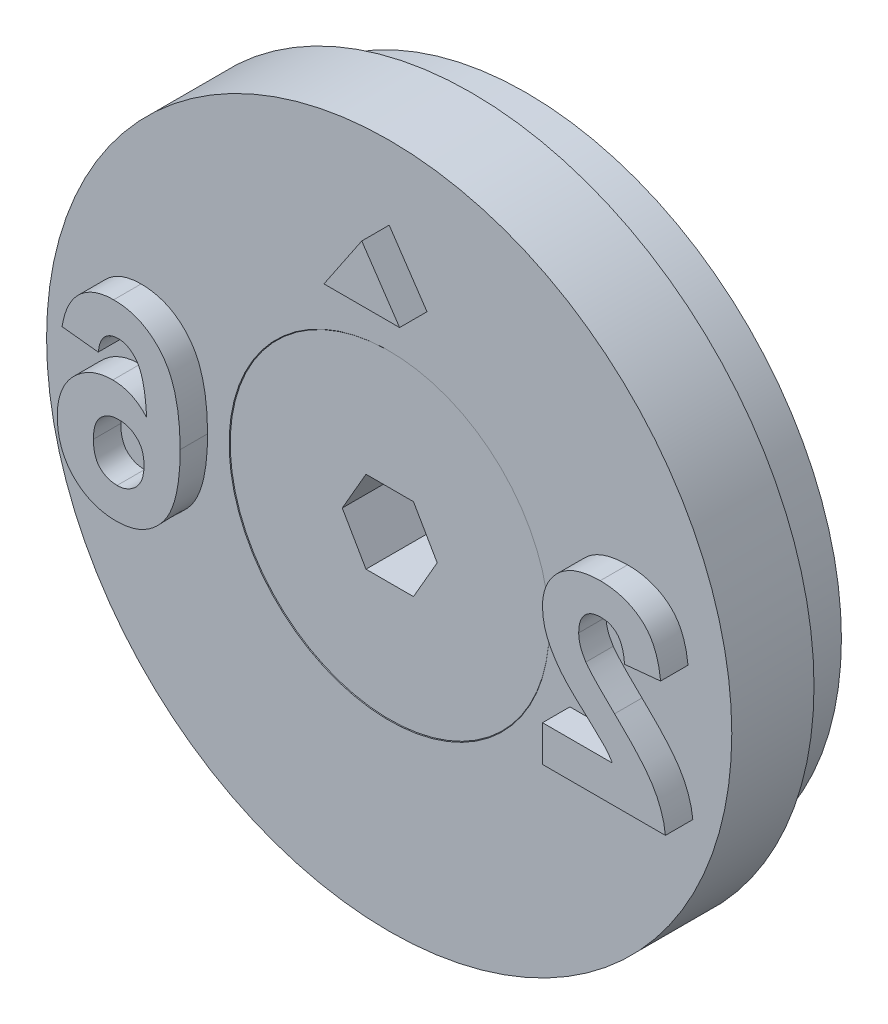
ISO-10303-21;
HEADER;
FILE_DESCRIPTION(('STEP AP214'),'2;1');
FILE_NAME('part.step','',(''),(''),'','','');
FILE_SCHEMA(('AUTOMOTIVE_DESIGN { 1 0 10303 214 1 1 1 1 }'));
ENDSEC;
DATA;
#1=APPLICATION_CONTEXT('core data for automotive mechanical design processes');
#2=APPLICATION_PROTOCOL_DEFINITION('international standard','automotive_design',2000,#1);
#3=PRODUCT_CONTEXT('',#1,'mechanical');
#4=PRODUCT('Part','Part','',(#3));
#5=PRODUCT_RELATED_PRODUCT_CATEGORY('part','',(#4));
#6=PRODUCT_DEFINITION_FORMATION('','',#4);
#7=PRODUCT_DEFINITION_CONTEXT('part definition',#1,'design');
#8=PRODUCT_DEFINITION('design','',#6,#7);
#9=PRODUCT_DEFINITION_SHAPE('','',#8);
#10=(LENGTH_UNIT() NAMED_UNIT(*) SI_UNIT(.MILLI.,.METRE.));
#11=(NAMED_UNIT(*) PLANE_ANGLE_UNIT() SI_UNIT($,.RADIAN.));
#12=(NAMED_UNIT(*) SI_UNIT($,.STERADIAN.) SOLID_ANGLE_UNIT());
#13=UNCERTAINTY_MEASURE_WITH_UNIT(LENGTH_MEASURE(1.E-05),#10,'distance_accuracy_value','');
#14=(GEOMETRIC_REPRESENTATION_CONTEXT(3) GLOBAL_UNCERTAINTY_ASSIGNED_CONTEXT((#13)) GLOBAL_UNIT_ASSIGNED_CONTEXT((#10,
#11,#12)) REPRESENTATION_CONTEXT('',''));
#15=CARTESIAN_POINT('',(0.,0.,0.));
#16=DIRECTION('',(0.,0.,1.));
#17=DIRECTION('',(1.,0.,0.));
#18=AXIS2_PLACEMENT_3D('',#15,#16,#17);
#19=CARTESIAN_POINT('',(0.,0.,-0.0199999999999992));
#20=DIRECTION('',(0.,0.,1.));
#21=DIRECTION('',(1.,0.,0.));
#22=AXIS2_PLACEMENT_3D('',#19,#20,#21);
#23=CYLINDRICAL_SURFACE('',#22,2.5);
#24=CARTESIAN_POINT('',(0.,0.,-3.34));
#25=DIRECTION('',(0.,0.,1.));
#26=DIRECTION('',(1.,0.,0.));
#27=AXIS2_PLACEMENT_3D('',#24,#25,#26);
#28=CIRCLE('',#27,2.5);
#29=CARTESIAN_POINT('',(2.5,0.,-3.34));
#30=VERTEX_POINT('',#29);
#31=EDGE_CURVE('E12',#30,#30,#28,.T.);
#32=ORIENTED_EDGE('',*,*,#31,.F.);
#33=EDGE_LOOP('',(#32));
#34=FACE_BOUND('',#33,.T.);
#35=CARTESIAN_POINT('',(0.,0.,-9.77));
#36=DIRECTION('',(0.,0.,1.));
#37=DIRECTION('',(1.,0.,0.));
#38=AXIS2_PLACEMENT_3D('',#35,#36,#37);
#39=CIRCLE('',#38,2.5);
#40=CARTESIAN_POINT('',(2.5,0.,-9.77));
#41=VERTEX_POINT('',#40);
#42=EDGE_CURVE('E151',#41,#41,#39,.T.);
#43=ORIENTED_EDGE('',*,*,#42,.T.);
#44=EDGE_LOOP('',(#43));
#45=FACE_BOUND('',#44,.T.);
#46=ADVANCED_FACE('F50',(#34,#45),#23,.T.);
#47=CARTESIAN_POINT('',(0.,0.,-3.34));
#48=DIRECTION('',(0.,0.,1.));
#49=DIRECTION('',(1.,0.,0.));
#50=AXIS2_PLACEMENT_3D('',#47,#48,#49);
#51=CONICAL_SURFACE('',#50,2.5,0.785398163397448);
#52=CARTESIAN_POINT('',(0.,0.,-0.0199999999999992));
#53=DIRECTION('',(0.,0.,1.));
#54=DIRECTION('',(1.,0.,0.));
#55=AXIS2_PLACEMENT_3D('',#52,#53,#54);
#56=CIRCLE('',#55,5.82);
#57=CARTESIAN_POINT('',(5.82,0.,-0.0199999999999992));
#58=VERTEX_POINT('',#57);
#59=EDGE_CURVE('E57',#58,#58,#56,.T.);
#60=ORIENTED_EDGE('',*,*,#59,.F.);
#61=EDGE_LOOP('',(#60));
#62=FACE_BOUND('',#61,.T.);
#63=ORIENTED_EDGE('',*,*,#31,.T.);
#64=EDGE_LOOP('',(#63));
#65=FACE_BOUND('',#64,.T.);
#66=ADVANCED_FACE('F166',(#62,#65),#51,.T.);
#67=CARTESIAN_POINT('',(0.,5.82,-0.0199999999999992));
#68=DIRECTION('',(0.,0.,-1.));
#69=DIRECTION('',(-1.,0.,0.));
#70=AXIS2_PLACEMENT_3D('',#67,#68,#69);
#71=PLANE('',#70);
#72=DIRECTION('',(1.,0.,0.));
#73=VECTOR('',#72,1.);
#74=CARTESIAN_POINT('',(-0.866025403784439,-1.5,-0.0199999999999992));
#75=LINE('',#74,#73);
#76=CARTESIAN_POINT('',(-0.866025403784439,-1.5,-0.0199999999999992));
#77=VERTEX_POINT('',#76);
#78=CARTESIAN_POINT('',(0.866025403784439,-1.5,-0.0199999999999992));
#79=VERTEX_POINT('',#78);
#80=EDGE_CURVE('E138',#77,#79,#75,.T.);
#81=ORIENTED_EDGE('',*,*,#80,.F.);
#82=DIRECTION('',(0.5,-0.866025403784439,0.));
#83=VECTOR('',#82,1.);
#84=CARTESIAN_POINT('',(-1.73205080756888,0.,-0.0199999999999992));
#85=LINE('',#84,#83);
#86=CARTESIAN_POINT('',(-1.73205080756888,0.,-0.0199999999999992));
#87=VERTEX_POINT('',#86);
#88=EDGE_CURVE('E64',#87,#77,#85,.T.);
#89=ORIENTED_EDGE('',*,*,#88,.F.);
#90=DIRECTION('',(-0.5,-0.866025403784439,0.));
#91=VECTOR('',#90,1.);
#92=CARTESIAN_POINT('',(-0.866025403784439,1.5,-0.0199999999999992));
#93=LINE('',#92,#91);
#94=CARTESIAN_POINT('',(-0.866025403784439,1.5,-0.0199999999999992));
#95=VERTEX_POINT('',#94);
#96=EDGE_CURVE('E147',#95,#87,#93,.T.);
#97=ORIENTED_EDGE('',*,*,#96,.F.);
#98=DIRECTION('',(-1.,0.,0.));
#99=VECTOR('',#98,1.);
#100=CARTESIAN_POINT('',(0.866025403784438,1.5,-0.0199999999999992));
#101=LINE('',#100,#99);
#102=CARTESIAN_POINT('',(0.866025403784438,1.5,-0.0199999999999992));
#103=VERTEX_POINT('',#102);
#104=EDGE_CURVE('E145',#103,#95,#101,.T.);
#105=ORIENTED_EDGE('',*,*,#104,.F.);
#106=DIRECTION('',(-0.5,0.866025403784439,0.));
#107=VECTOR('',#106,1.);
#108=CARTESIAN_POINT('',(1.73205080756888,0.,-0.0199999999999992));
#109=LINE('',#108,#107);
#110=CARTESIAN_POINT('',(1.73205080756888,0.,-0.0199999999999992));
#111=VERTEX_POINT('',#110);
#112=EDGE_CURVE('E112',#111,#103,#109,.T.);
#113=ORIENTED_EDGE('',*,*,#112,.F.);
#114=DIRECTION('',(0.5,0.866025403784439,0.));
#115=VECTOR('',#114,1.);
#116=CARTESIAN_POINT('',(0.866025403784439,-1.5,-0.0199999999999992));
#117=LINE('',#116,#115);
#118=EDGE_CURVE('E141',#79,#111,#117,.T.);
#119=ORIENTED_EDGE('',*,*,#118,.F.);
#120=EDGE_LOOP('',(#81,#89,#97,#105,#113,#119));
#121=FACE_BOUND('',#120,.T.);
#122=ORIENTED_EDGE('',*,*,#59,.T.);
#123=EDGE_LOOP('',(#122));
#124=FACE_BOUND('',#123,.T.);
#125=ADVANCED_FACE('F164',(#121,#124),#71,.F.);
#126=CARTESIAN_POINT('',(0.,0.,-10.02));
#127=DIRECTION('',(0.,0.,1.));
#128=DIRECTION('',(1.,0.,0.));
#129=AXIS2_PLACEMENT_3D('',#126,#127,#128);
#130=PLANE('',#129);
#131=CARTESIAN_POINT('',(0.,0.,-10.02));
#132=DIRECTION('',(0.,0.,1.));
#133=DIRECTION('',(1.,0.,0.));
#134=AXIS2_PLACEMENT_3D('',#131,#132,#133);
#135=CIRCLE('',#134,2.25);
#136=CARTESIAN_POINT('',(2.25,0.,-10.02));
#137=VERTEX_POINT('',#136);
#138=EDGE_CURVE('E159',#137,#137,#135,.T.);
#139=ORIENTED_EDGE('',*,*,#138,.F.);
#140=EDGE_LOOP('',(#139));
#141=FACE_BOUND('',#140,.T.);
#142=ADVANCED_FACE('F179',(#141),#130,.F.);
#143=CARTESIAN_POINT('',(0.,0.,-10.02));
#144=DIRECTION('',(0.,0.,1.));
#145=DIRECTION('',(1.,0.,0.));
#146=AXIS2_PLACEMENT_3D('',#143,#144,#145);
#147=CONICAL_SURFACE('',#146,2.25,0.78539816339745);
#148=ORIENTED_EDGE('',*,*,#42,.F.);
#149=EDGE_LOOP('',(#148));
#150=FACE_BOUND('',#149,.T.);
#151=ORIENTED_EDGE('',*,*,#138,.T.);
#152=EDGE_LOOP('',(#151));
#153=FACE_BOUND('',#152,.T.);
#154=ADVANCED_FACE('F175',(#150,#153),#147,.T.);
#155=CARTESIAN_POINT('',(-1.73205080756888,0.,-2.52));
#156=DIRECTION('',(-0.866025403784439,-0.5,0.));
#157=DIRECTION('',(0.5,-0.866025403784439,0.));
#158=AXIS2_PLACEMENT_3D('',#155,#156,#157);
#159=PLANE('',#158);
#160=ORIENTED_EDGE('',*,*,#88,.T.);
#161=DIRECTION('',(0.,0.,1.));
#162=VECTOR('',#161,1.);
#163=CARTESIAN_POINT('',(-0.866025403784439,-1.5,-2.52));
#164=LINE('',#163,#162);
#165=CARTESIAN_POINT('',(-0.866025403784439,-1.5,-2.52));
#166=VERTEX_POINT('',#165);
#167=EDGE_CURVE('E94',#166,#77,#164,.T.);
#168=ORIENTED_EDGE('',*,*,#167,.F.);
#169=DIRECTION('',(0.5,-0.866025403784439,0.));
#170=VECTOR('',#169,1.);
#171=CARTESIAN_POINT('',(-1.73205080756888,0.,-2.52));
#172=LINE('',#171,#170);
#173=CARTESIAN_POINT('',(-1.73205080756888,0.,-2.52));
#174=VERTEX_POINT('',#173);
#175=EDGE_CURVE('E149',#174,#166,#172,.T.);
#176=ORIENTED_EDGE('',*,*,#175,.F.);
#177=DIRECTION('',(0.,0.,1.));
#178=VECTOR('',#177,1.);
#179=CARTESIAN_POINT('',(-1.73205080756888,0.,-2.52));
#180=LINE('',#179,#178);
#181=EDGE_CURVE('E72',#174,#87,#180,.T.);
#182=ORIENTED_EDGE('',*,*,#181,.T.);
#183=EDGE_LOOP('',(#160,#168,#176,#182));
#184=FACE_BOUND('',#183,.T.);
#185=ADVANCED_FACE('F178',(#184),#159,.F.);
#186=CARTESIAN_POINT('',(-0.866025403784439,1.5,-2.52));
#187=DIRECTION('',(-0.866025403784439,0.5,0.));
#188=DIRECTION('',(-0.5,-0.866025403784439,0.));
#189=AXIS2_PLACEMENT_3D('',#186,#187,#188);
#190=PLANE('',#189);
#191=ORIENTED_EDGE('',*,*,#96,.T.);
#192=ORIENTED_EDGE('',*,*,#181,.F.);
#193=DIRECTION('',(-0.5,-0.866025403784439,0.));
#194=VECTOR('',#193,1.);
#195=CARTESIAN_POINT('',(-0.866025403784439,1.5,-2.52));
#196=LINE('',#195,#194);
#197=CARTESIAN_POINT('',(-0.866025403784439,1.5,-2.52));
#198=VERTEX_POINT('',#197);
#199=EDGE_CURVE('E124',#198,#174,#196,.T.);
#200=ORIENTED_EDGE('',*,*,#199,.F.);
#201=DIRECTION('',(0.,0.,1.));
#202=VECTOR('',#201,1.);
#203=CARTESIAN_POINT('',(-0.866025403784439,1.5,-2.52));
#204=LINE('',#203,#202);
#205=EDGE_CURVE('E116',#198,#95,#204,.T.);
#206=ORIENTED_EDGE('',*,*,#205,.T.);
#207=EDGE_LOOP('',(#191,#192,#200,#206));
#208=FACE_BOUND('',#207,.T.);
#209=ADVANCED_FACE('F193',(#208),#190,.F.);
#210=CARTESIAN_POINT('',(0.866025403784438,1.5,-2.52));
#211=DIRECTION('',(0.,1.,0.));
#212=DIRECTION('',(-1.,0.,0.));
#213=AXIS2_PLACEMENT_3D('',#210,#211,#212);
#214=PLANE('',#213);
#215=ORIENTED_EDGE('',*,*,#104,.T.);
#216=ORIENTED_EDGE('',*,*,#205,.F.);
#217=DIRECTION('',(-1.,0.,0.));
#218=VECTOR('',#217,1.);
#219=CARTESIAN_POINT('',(0.866025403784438,1.5,-2.52));
#220=LINE('',#219,#218);
#221=CARTESIAN_POINT('',(0.866025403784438,1.5,-2.52));
#222=VERTEX_POINT('',#221);
#223=EDGE_CURVE('E120',#222,#198,#220,.T.);
#224=ORIENTED_EDGE('',*,*,#223,.F.);
#225=DIRECTION('',(0.,0.,1.));
#226=VECTOR('',#225,1.);
#227=CARTESIAN_POINT('',(0.866025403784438,1.5,-2.52));
#228=LINE('',#227,#226);
#229=EDGE_CURVE('E105',#222,#103,#228,.T.);
#230=ORIENTED_EDGE('',*,*,#229,.T.);
#231=EDGE_LOOP('',(#215,#216,#224,#230));
#232=FACE_BOUND('',#231,.T.);
#233=ADVANCED_FACE('F121',(#232),#214,.F.);
#234=CARTESIAN_POINT('',(1.73205080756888,0.,-2.52));
#235=DIRECTION('',(0.866025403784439,0.5,0.));
#236=DIRECTION('',(-0.5,0.866025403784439,0.));
#237=AXIS2_PLACEMENT_3D('',#234,#235,#236);
#238=PLANE('',#237);
#239=ORIENTED_EDGE('',*,*,#112,.T.);
#240=ORIENTED_EDGE('',*,*,#229,.F.);
#241=DIRECTION('',(-0.5,0.866025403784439,0.));
#242=VECTOR('',#241,1.);
#243=CARTESIAN_POINT('',(1.73205080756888,0.,-2.52));
#244=LINE('',#243,#242);
#245=CARTESIAN_POINT('',(1.73205080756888,0.,-2.52));
#246=VERTEX_POINT('',#245);
#247=EDGE_CURVE('E109',#246,#222,#244,.T.);
#248=ORIENTED_EDGE('',*,*,#247,.F.);
#249=DIRECTION('',(0.,0.,1.));
#250=VECTOR('',#249,1.);
#251=CARTESIAN_POINT('',(1.73205080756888,0.,-2.52));
#252=LINE('',#251,#250);
#253=EDGE_CURVE('E117',#246,#111,#252,.T.);
#254=ORIENTED_EDGE('',*,*,#253,.T.);
#255=EDGE_LOOP('',(#239,#240,#248,#254));
#256=FACE_BOUND('',#255,.T.);
#257=ADVANCED_FACE('F107',(#256),#238,.F.);
#258=CARTESIAN_POINT('',(0.866025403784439,-1.5,-2.52));
#259=DIRECTION('',(0.866025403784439,-0.5,0.));
#260=DIRECTION('',(0.5,0.866025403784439,0.));
#261=AXIS2_PLACEMENT_3D('',#258,#259,#260);
#262=PLANE('',#261);
#263=ORIENTED_EDGE('',*,*,#118,.T.);
#264=ORIENTED_EDGE('',*,*,#253,.F.);
#265=DIRECTION('',(0.5,0.866025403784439,0.));
#266=VECTOR('',#265,1.);
#267=CARTESIAN_POINT('',(0.866025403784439,-1.5,-2.52));
#268=LINE('',#267,#266);
#269=CARTESIAN_POINT('',(0.866025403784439,-1.5,-2.52));
#270=VERTEX_POINT('',#269);
#271=EDGE_CURVE('E130',#270,#246,#268,.T.);
#272=ORIENTED_EDGE('',*,*,#271,.F.);
#273=DIRECTION('',(0.,0.,1.));
#274=VECTOR('',#273,1.);
#275=CARTESIAN_POINT('',(0.866025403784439,-1.5,-2.52));
#276=LINE('',#275,#274);
#277=EDGE_CURVE('E154',#270,#79,#276,.T.);
#278=ORIENTED_EDGE('',*,*,#277,.T.);
#279=EDGE_LOOP('',(#263,#264,#272,#278));
#280=FACE_BOUND('',#279,.T.);
#281=ADVANCED_FACE('F197',(#280),#262,.F.);
#282=CARTESIAN_POINT('',(-0.866025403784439,-1.5,-2.52));
#283=DIRECTION('',(0.,-1.,0.));
#284=DIRECTION('',(0.,0.,-1.));
#285=AXIS2_PLACEMENT_3D('',#282,#283,#284);
#286=PLANE('',#285);
#287=ORIENTED_EDGE('',*,*,#80,.T.);
#288=ORIENTED_EDGE('',*,*,#277,.F.);
#289=DIRECTION('',(1.,0.,0.));
#290=VECTOR('',#289,1.);
#291=CARTESIAN_POINT('',(-0.866025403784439,-1.5,-2.52));
#292=LINE('',#291,#290);
#293=EDGE_CURVE('E132',#166,#270,#292,.T.);
#294=ORIENTED_EDGE('',*,*,#293,.F.);
#295=ORIENTED_EDGE('',*,*,#167,.T.);
#296=EDGE_LOOP('',(#287,#288,#294,#295));
#297=FACE_BOUND('',#296,.T.);
#298=ADVANCED_FACE('F194',(#297),#286,.F.);
#299=CARTESIAN_POINT('',(0.,0.,-2.52));
#300=DIRECTION('',(0.,0.,1.));
#301=DIRECTION('',(1.,0.,0.));
#302=AXIS2_PLACEMENT_3D('',#299,#300,#301);
#303=PLANE('',#302);
#304=ORIENTED_EDGE('',*,*,#175,.T.);
#305=ORIENTED_EDGE('',*,*,#293,.T.);
#306=ORIENTED_EDGE('',*,*,#271,.T.);
#307=ORIENTED_EDGE('',*,*,#247,.T.);
#308=ORIENTED_EDGE('',*,*,#223,.T.);
#309=ORIENTED_EDGE('',*,*,#199,.T.);
#310=EDGE_LOOP('',(#304,#305,#306,#307,#308,#309));
#311=FACE_BOUND('',#310,.T.);
#312=ADVANCED_FACE('F127',(#311),#303,.T.);
#313=CLOSED_SHELL('',(#46,#66,#125,#142,#154,#185,#209,#233,#257,#281,#298,#312));
#314=MANIFOLD_SOLID_BREP('B2',#313);
#315=CARTESIAN_POINT('',(1.3800444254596,7.76799984,1.));
#316=DIRECTION('',(-0.829037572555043,-0.559192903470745,0.));
#317=DIRECTION('',(0.559192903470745,-0.829037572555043,0.));
#318=AXIS2_PLACEMENT_3D('',#315,#316,#317);
#319=PLANE('',#318);
#320=DIRECTION('',(-0.559192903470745,0.829037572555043,0.));
#321=VECTOR('',#320,1.);
#322=CARTESIAN_POINT('',(1.3800444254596,7.76799984,0.));
#323=LINE('',#322,#321);
#324=CARTESIAN_POINT('',(1.3800444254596,7.76799984,0.));
#325=VERTEX_POINT('',#324);
#326=CARTESIAN_POINT('',(0.,9.81399984,0.));
#327=VERTEX_POINT('',#326);
#328=EDGE_CURVE('E366',#325,#327,#323,.T.);
#329=ORIENTED_EDGE('',*,*,#328,.T.);
#330=DIRECTION('',(0.,0.,-1.));
#331=VECTOR('',#330,1.);
#332=CARTESIAN_POINT('',(0.,9.81399984,1.));
#333=LINE('',#332,#331);
#334=CARTESIAN_POINT('',(0.,9.81399984,1.));
#335=VERTEX_POINT('',#334);
#336=EDGE_CURVE('E48',#335,#327,#333,.T.);
#337=ORIENTED_EDGE('',*,*,#336,.F.);
#338=DIRECTION('',(-0.559192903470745,0.829037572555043,0.));
#339=VECTOR('',#338,1.);
#340=CARTESIAN_POINT('',(1.3800444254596,7.76799984,1.));
#341=LINE('',#340,#339);
#342=CARTESIAN_POINT('',(1.3800444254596,7.76799984,1.));
#343=VERTEX_POINT('',#342);
#344=EDGE_CURVE('E359',#343,#335,#341,.T.);
#345=ORIENTED_EDGE('',*,*,#344,.F.);
#346=DIRECTION('',(0.,0.,-1.));
#347=VECTOR('',#346,1.);
#348=CARTESIAN_POINT('',(1.3800444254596,7.76799984,1.));
#349=LINE('',#348,#347);
#350=EDGE_CURVE('E367',#343,#325,#349,.T.);
#351=ORIENTED_EDGE('',*,*,#350,.T.);
#352=EDGE_LOOP('',(#329,#337,#345,#351));
#353=FACE_BOUND('',#352,.T.);
#354=ADVANCED_FACE('F319',(#353),#319,.F.);
#355=CARTESIAN_POINT('',(0.,9.81399984,1.));
#356=DIRECTION('',(0.829037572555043,-0.559192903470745,0.));
#357=DIRECTION('',(0.559192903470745,0.829037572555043,0.));
#358=AXIS2_PLACEMENT_3D('',#355,#356,#357);
#359=PLANE('',#358);
#360=DIRECTION('',(-0.559192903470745,-0.829037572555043,0.));
#361=VECTOR('',#360,1.);
#362=CARTESIAN_POINT('',(0.,9.81399984,0.));
#363=LINE('',#362,#361);
#364=CARTESIAN_POINT('',(-1.3800444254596,7.76799984,0.));
#365=VERTEX_POINT('',#364);
#366=EDGE_CURVE('E347',#327,#365,#363,.T.);
#367=ORIENTED_EDGE('',*,*,#366,.T.);
#368=DIRECTION('',(0.,0.,-1.));
#369=VECTOR('',#368,1.);
#370=CARTESIAN_POINT('',(-1.3800444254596,7.76799984,1.));
#371=LINE('',#370,#369);
#372=CARTESIAN_POINT('',(-1.3800444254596,7.76799984,1.));
#373=VERTEX_POINT('',#372);
#374=EDGE_CURVE('E327',#373,#365,#371,.T.);
#375=ORIENTED_EDGE('',*,*,#374,.F.);
#376=DIRECTION('',(-0.559192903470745,-0.829037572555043,0.));
#377=VECTOR('',#376,1.);
#378=CARTESIAN_POINT('',(0.,9.81399984,1.));
#379=LINE('',#378,#377);
#380=EDGE_CURVE('E355',#335,#373,#379,.T.);
#381=ORIENTED_EDGE('',*,*,#380,.F.);
#382=ORIENTED_EDGE('',*,*,#336,.T.);
#383=EDGE_LOOP('',(#367,#375,#381,#382));
#384=FACE_BOUND('',#383,.T.);
#385=ADVANCED_FACE('F356',(#384),#359,.F.);
#386=CARTESIAN_POINT('',(-1.3800444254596,7.76799984,1.));
#387=DIRECTION('',(0.,1.,0.));
#388=DIRECTION('',(0.,0.,1.));
#389=AXIS2_PLACEMENT_3D('',#386,#387,#388);
#390=PLANE('',#389);
#391=DIRECTION('',(1.,0.,0.));
#392=VECTOR('',#391,1.);
#393=CARTESIAN_POINT('',(-1.3800444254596,7.76799984,0.));
#394=LINE('',#393,#392);
#395=EDGE_CURVE('E352',#365,#325,#394,.T.);
#396=ORIENTED_EDGE('',*,*,#395,.T.);
#397=ORIENTED_EDGE('',*,*,#350,.F.);
#398=DIRECTION('',(1.,0.,0.));
#399=VECTOR('',#398,1.);
#400=CARTESIAN_POINT('',(-1.3800444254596,7.76799984,1.));
#401=LINE('',#400,#399);
#402=EDGE_CURVE('E335',#373,#343,#401,.T.);
#403=ORIENTED_EDGE('',*,*,#402,.F.);
#404=ORIENTED_EDGE('',*,*,#374,.T.);
#405=EDGE_LOOP('',(#396,#397,#403,#404));
#406=FACE_BOUND('',#405,.T.);
#407=ADVANCED_FACE('F374',(#406),#390,.F.);
#408=CARTESIAN_POINT('',(0.,0.,1.));
#409=DIRECTION('',(0.,0.,1.));
#410=DIRECTION('',(1.,0.,0.));
#411=AXIS2_PLACEMENT_3D('',#408,#409,#410);
#412=PLANE('',#411);
#413=ORIENTED_EDGE('',*,*,#344,.T.);
#414=ORIENTED_EDGE('',*,*,#380,.T.);
#415=ORIENTED_EDGE('',*,*,#402,.T.);
#416=EDGE_LOOP('',(#413,#414,#415));
#417=FACE_BOUND('',#416,.T.);
#418=ADVANCED_FACE('F362',(#417),#412,.T.);
#419=CARTESIAN_POINT('',(0.,0.,0.));
#420=DIRECTION('',(0.,0.,1.));
#421=DIRECTION('',(1.,0.,0.));
#422=AXIS2_PLACEMENT_3D('',#419,#420,#421);
#423=PLANE('',#422);
#424=ORIENTED_EDGE('',*,*,#328,.F.);
#425=ORIENTED_EDGE('',*,*,#395,.F.);
#426=ORIENTED_EDGE('',*,*,#366,.F.);
#427=EDGE_LOOP('',(#424,#425,#426));
#428=FACE_BOUND('',#427,.T.);
#429=ADVANCED_FACE('F375',(#428),#423,.F.);
#430=CLOSED_SHELL('',(#354,#385,#407,#418,#429));
#431=MANIFOLD_SOLID_BREP('B6',#430);
#432=CARTESIAN_POINT('',(0.,12.5,0.));
#433=DIRECTION('',(0.,0.,-1.));
#434=DIRECTION('',(-1.,0.,0.));
#435=AXIS2_PLACEMENT_3D('',#432,#433,#434);
#436=PLANE('',#435);
#437=DIRECTION('',(-1.,0.,0.));
#438=VECTOR('',#437,1.);
#439=CARTESIAN_POINT('',(9.14262620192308,-2.11015384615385,0.));
#440=LINE('',#439,#438);
#441=CARTESIAN_POINT('',(9.14262620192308,-2.11015384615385,0.));
#442=VERTEX_POINT('',#441);
#443=CARTESIAN_POINT('',(6.59423076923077,-2.11015384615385,0.));
#444=VERTEX_POINT('',#443);
#445=EDGE_CURVE('E759',#442,#444,#440,.T.);
#446=ORIENTED_EDGE('',*,*,#445,.F.);
#447=CARTESIAN_POINT('',(7.25914903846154,-0.156612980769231,0.));
#448=CARTESIAN_POINT('',(7.28000828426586,-0.182885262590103,0.));
#449=CARTESIAN_POINT('',(7.3246839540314,-0.239154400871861,0.));
#450=CARTESIAN_POINT('',(7.40068900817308,-0.325434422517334,0.));
#451=CARTESIAN_POINT('',(7.48877232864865,-0.419679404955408,0.));
#452=CARTESIAN_POINT('',(7.58768977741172,-0.523653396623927,0.));
#453=CARTESIAN_POINT('',(7.70070879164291,-0.6336743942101,0.));
#454=CARTESIAN_POINT('',(7.82376294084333,-0.754343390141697,0.));
#455=CARTESIAN_POINT('',(7.96226696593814,-0.87948776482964,0.));
#456=CARTESIAN_POINT('',(8.10572357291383,-1.0122292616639,0.));
#457=CARTESIAN_POINT('',(8.24980374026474,-1.14142469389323,0.));
#458=CARTESIAN_POINT('',(8.38223418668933,-1.2641317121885,0.));
#459=CARTESIAN_POINT('',(8.50252509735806,-1.37270106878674,0.));
#460=CARTESIAN_POINT('',(8.6050742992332,-1.47312629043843,0.));
#461=CARTESIAN_POINT('',(8.69591371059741,-1.55855342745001,0.));
#462=CARTESIAN_POINT('',(8.77176917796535,-1.63336308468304,0.));
#463=CARTESIAN_POINT('',(8.83406013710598,-1.69574418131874,0.));
#464=CARTESIAN_POINT('',(8.91989306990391,-1.79298048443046,0.));
#465=CARTESIAN_POINT('',(9.02910573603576,-1.92449262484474,0.));
#466=CARTESIAN_POINT('',(9.10594131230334,-2.05015619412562,0.));
#467=CARTESIAN_POINT('',(9.14262620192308,-2.11015384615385,0.));
#468=B_SPLINE_CURVE_WITH_KNOTS('',3,(#447,#448,#449,#450,#451,#452,#453,#454,#455,#456,#457,
#458,#459,#460,#461,#462,#463,#464,#465,#466,#467),.UNSPECIFIED.,.F.,.F.,(4,1,1,1,1,1,1,1,1,1,1,
1,1,1,1,1,1,1,4),(0.,0.0369753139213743,0.0791925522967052,0.126700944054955,0.179184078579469,
0.237368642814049,0.300558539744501,0.369153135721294,0.443112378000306,0.516018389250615,
0.582473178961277,0.642136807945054,0.694619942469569,0.740679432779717,0.779589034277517,
0.812073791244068,0.837814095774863,0.922564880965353,1.),.UNSPECIFIED.);
#469=CARTESIAN_POINT('',(7.25914903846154,-0.156612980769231,0.));
#470=VERTEX_POINT('',#469);
#471=EDGE_CURVE('E764',#470,#442,#468,.T.);
#472=ORIENTED_EDGE('',*,*,#471,.F.);
#473=CARTESIAN_POINT('',(6.59423076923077,1.56338221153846,0.));
#474=CARTESIAN_POINT('',(6.59590865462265,1.48862686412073,0.));
#475=CARTESIAN_POINT('',(6.59923732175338,1.34032372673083,0.));
#476=CARTESIAN_POINT('',(6.63110683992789,1.12108738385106,0.));
#477=CARTESIAN_POINT('',(6.67979725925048,0.906906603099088,0.));
#478=CARTESIAN_POINT('',(6.75175786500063,0.69725794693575,0.));
#479=CARTESIAN_POINT('',(6.84297351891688,0.487112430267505,0.));
#480=CARTESIAN_POINT('',(6.96055268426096,0.275998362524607,0.));
#481=CARTESIAN_POINT('',(7.09707098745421,0.0575489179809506,0.));
#482=CARTESIAN_POINT('',(7.20395943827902,-0.0836881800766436,0.));
#483=CARTESIAN_POINT('',(7.25914903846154,-0.156612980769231,0.));
#484=B_SPLINE_CURVE_WITH_KNOTS('',3,(#473,#474,#475,#476,#477,#478,#479,#480,#481,#482,#483),
.UNSPECIFIED.,.F.,.F.,(4,1,1,1,1,1,1,1,4),(0.,0.119176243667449,0.236427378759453,
0.352663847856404,0.469086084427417,0.589462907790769,0.717601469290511,0.854189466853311,1.),.UNSPECIFIED.);
#485=CARTESIAN_POINT('',(6.59423076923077,1.56338221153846,0.));
#486=VERTEX_POINT('',#485);
#487=EDGE_CURVE('E968',#486,#470,#484,.T.);
#488=ORIENTED_EDGE('',*,*,#487,.F.);
#489=CARTESIAN_POINT('',(8.69888942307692,3.429,0.));
#490=CARTESIAN_POINT('',(8.6191501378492,3.42746745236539,0.));
#491=CARTESIAN_POINT('',(8.46384786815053,3.42448262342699,0.));
#492=CARTESIAN_POINT('',(8.23713412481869,3.39983388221,0.));
#493=CARTESIAN_POINT('',(8.02415285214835,3.35685523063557,0.));
#494=CARTESIAN_POINT('',(7.82304201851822,3.2999239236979,0.));
#495=CARTESIAN_POINT('',(7.63586692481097,3.22391646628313,0.));
#496=CARTESIAN_POINT('',(7.46106784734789,3.13202661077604,0.));
#497=CARTESIAN_POINT('',(7.30139581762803,3.02076695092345,0.));
#498=CARTESIAN_POINT('',(7.15447070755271,2.89620494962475,0.));
#499=CARTESIAN_POINT('',(7.02313141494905,2.75922713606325,0.));
#500=CARTESIAN_POINT('',(6.90809007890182,2.61311713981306,0.));
#501=CARTESIAN_POINT('',(6.81170882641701,2.45797675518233,0.));
#502=CARTESIAN_POINT('',(6.73083015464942,2.29569697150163,0.));
#503=CARTESIAN_POINT('',(6.67077828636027,2.12366647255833,0.));
#504=CARTESIAN_POINT('',(6.62702188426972,1.94426396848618,0.));
#505=CARTESIAN_POINT('',(6.59800962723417,1.75665250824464,0.));
#506=CARTESIAN_POINT('',(6.59550431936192,1.62851813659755,0.));
#507=CARTESIAN_POINT('',(6.59423076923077,1.56338221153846,0.));
#508=B_SPLINE_CURVE_WITH_KNOTS('',3,(#489,#490,#491,#492,#493,#494,#495,#496,#497,#498,#499,
#500,#501,#502,#503,#504,#505,#506,#507),.UNSPECIFIED.,.F.,.F.,(4,1,1,1,1,1,1,1,1,1,1,1,1,1,1,1,
4),(0.,0.0756723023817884,0.147381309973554,0.216084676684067,0.28169803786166,
0.345459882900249,0.407485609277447,0.468731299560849,0.529782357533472,0.590032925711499,
0.648548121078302,0.70595351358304,0.763101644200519,0.820289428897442,0.878479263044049,
0.938226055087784,1.),.UNSPECIFIED.);
#509=CARTESIAN_POINT('',(8.69888942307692,3.429,0.));
#510=VERTEX_POINT('',#509);
#511=EDGE_CURVE('E960',#510,#486,#508,.T.);
#512=ORIENTED_EDGE('',*,*,#511,.F.);
#513=CARTESIAN_POINT('',(10.9024615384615,1.36006009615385,0.));
#514=CARTESIAN_POINT('',(10.891858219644,1.4490988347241,0.));
#515=CARTESIAN_POINT('',(10.8713000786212,1.62173072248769,0.));
#516=CARTESIAN_POINT('',(10.8199968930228,1.86968963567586,0.));
#517=CARTESIAN_POINT('',(10.7550233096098,2.09844292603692,0.));
#518=CARTESIAN_POINT('',(10.6732818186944,2.3075660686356,0.));
#519=CARTESIAN_POINT('',(10.5781508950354,2.49838888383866,0.));
#520=CARTESIAN_POINT('',(10.4647780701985,2.66804795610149,0.));
#521=CARTESIAN_POINT('',(10.3371247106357,2.81842262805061,0.));
#522=CARTESIAN_POINT('',(10.1950804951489,2.94943286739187,0.));
#523=CARTESIAN_POINT('',(10.0395484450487,3.06149545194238,0.));
#524=CARTESIAN_POINT('',(9.8763454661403,3.1615285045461,0.));
#525=CARTESIAN_POINT('',(9.70228211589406,3.2435874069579,0.));
#526=CARTESIAN_POINT('',(9.51927483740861,3.311216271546,0.));
#527=CARTESIAN_POINT('',(9.32740633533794,3.36526471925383,0.));
#528=CARTESIAN_POINT('',(9.12578919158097,3.40100082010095,0.));
#529=CARTESIAN_POINT('',(8.91566771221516,3.42613773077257,0.));
#530=CARTESIAN_POINT('',(8.77223791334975,3.4280315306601,0.));
#531=CARTESIAN_POINT('',(8.69888942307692,3.429,0.));
#532=B_SPLINE_CURVE_WITH_KNOTS('',3,(#513,#514,#515,#516,#517,#518,#519,#520,#521,#522,#523,
#524,#525,#526,#527,#528,#529,#530,#531),.UNSPECIFIED.,.F.,.F.,(4,1,1,1,1,1,1,1,1,1,1,1,1,1,1,1,
4),(0.,0.0794357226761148,0.154013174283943,0.224141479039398,0.289934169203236,
0.352732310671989,0.412725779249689,0.470302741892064,0.527168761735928,0.583502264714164,
0.639948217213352,0.696584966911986,0.753726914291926,0.812707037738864,0.872963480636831,
0.93503486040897,1.),.UNSPECIFIED.);
#533=CARTESIAN_POINT('',(10.9024615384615,1.36006009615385,0.));
#534=VERTEX_POINT('',#533);
#535=EDGE_CURVE('E955',#534,#510,#532,.T.);
#536=ORIENTED_EDGE('',*,*,#535,.F.);
#537=DIRECTION('',(0.995240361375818,0.0974506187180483,0.));
#538=VECTOR('',#537,1.);
#539=CARTESIAN_POINT('',(9.58361538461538,1.23092307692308,0.));
#540=LINE('',#539,#538);
#541=CARTESIAN_POINT('',(9.58361538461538,1.23092307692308,0.));
#542=VERTEX_POINT('',#541);
#543=EDGE_CURVE('E949',#542,#534,#540,.T.);
#544=ORIENTED_EDGE('',*,*,#543,.F.);
#545=CARTESIAN_POINT('',(8.72636538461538,2.286,0.));
#546=CARTESIAN_POINT('',(8.78618248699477,2.28328991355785,0.));
#547=CARTESIAN_POINT('',(8.90173621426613,2.27805461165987,0.));
#548=CARTESIAN_POINT('',(9.06596313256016,2.23231973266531,0.));
#549=CARTESIAN_POINT('',(9.2096313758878,2.15314784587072,0.));
#550=CARTESIAN_POINT('',(9.31201700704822,2.0629238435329,0.));
#551=CARTESIAN_POINT('',(9.38118335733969,1.9751875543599,0.));
#552=CARTESIAN_POINT('',(9.4283108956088,1.89873115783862,0.));
#553=CARTESIAN_POINT('',(9.46893115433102,1.81185324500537,0.));
#554=CARTESIAN_POINT('',(9.50492409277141,1.71553191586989,0.));
#555=CARTESIAN_POINT('',(9.53335444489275,1.60866370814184,0.));
#556=CARTESIAN_POINT('',(9.55625048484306,1.49206253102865,0.));
#557=CARTESIAN_POINT('',(9.57470138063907,1.3651009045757,0.));
#558=CARTESIAN_POINT('',(9.58056909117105,1.27677733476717,0.));
#559=CARTESIAN_POINT('',(9.58361538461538,1.23092307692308,0.));
#560=B_SPLINE_CURVE_WITH_KNOTS('',3,(#545,#546,#547,#548,#549,#550,#551,#552,#553,#554,#555,
#556,#557,#558,#559),.UNSPECIFIED.,.F.,.F.,(4,1,1,1,1,1,1,1,1,1,1,1,4),(0.,0.116899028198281,
0.225823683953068,0.330086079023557,0.435451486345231,0.490306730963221,0.548244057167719,
0.610766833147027,0.677675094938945,0.749188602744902,0.826858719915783,0.910111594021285,1.),.UNSPECIFIED.);
#561=CARTESIAN_POINT('',(8.72636538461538,2.286,0.));
#562=VERTEX_POINT('',#561);
#563=EDGE_CURVE('E941',#562,#542,#560,.T.);
#564=ORIENTED_EDGE('',*,*,#563,.F.);
#565=CARTESIAN_POINT('',(7.91307692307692,1.38616225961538,0.));
#566=CARTESIAN_POINT('',(7.91554694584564,1.4545870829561,0.));
#567=CARTESIAN_POINT('',(7.92022003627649,1.58404151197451,0.));
#568=CARTESIAN_POINT('',(7.95940470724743,1.76672564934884,0.));
#569=CARTESIAN_POINT('',(8.02889236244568,1.92376854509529,0.));
#570=CARTESIAN_POINT('',(8.12456407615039,2.05565224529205,0.));
#571=CARTESIAN_POINT('',(8.24554114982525,2.15898261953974,0.));
#572=CARTESIAN_POINT('',(8.38696686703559,2.23533373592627,0.));
#573=CARTESIAN_POINT('',(8.5509114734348,2.27754595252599,0.));
#574=CARTESIAN_POINT('',(8.66614141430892,2.28309817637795,0.));
#575=CARTESIAN_POINT('',(8.72636538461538,2.286,0.));
#576=B_SPLINE_CURVE_WITH_KNOTS('',3,(#565,#566,#567,#568,#569,#570,#571,#572,#573,#574,#575),
.UNSPECIFIED.,.F.,.F.,(4,1,1,1,1,1,1,1,4),(0.,0.149140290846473,0.282161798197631,
0.404655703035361,0.521109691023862,0.63441645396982,0.748796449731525,0.868710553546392,1.),.UNSPECIFIED.);
#577=CARTESIAN_POINT('',(7.91307692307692,1.38616225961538,0.));
#578=VERTEX_POINT('',#577);
#579=EDGE_CURVE('E933',#578,#562,#576,.T.);
#580=ORIENTED_EDGE('',*,*,#579,.F.);
#581=CARTESIAN_POINT('',(8.17409855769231,0.593480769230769,0.));
#582=CARTESIAN_POINT('',(8.13439107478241,0.659439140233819,0.));
#583=CARTESIAN_POINT('',(8.05779994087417,0.786665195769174,0.));
#584=CARTESIAN_POINT('',(7.97381140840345,0.986730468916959,0.));
#585=CARTESIAN_POINT('',(7.9233983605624,1.18675441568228,0.));
#586=CARTESIAN_POINT('',(7.91648032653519,1.32040927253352,0.));
#587=CARTESIAN_POINT('',(7.91307692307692,1.38616225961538,0.));
#588=B_SPLINE_CURVE_WITH_KNOTS('',3,(#581,#582,#583,#584,#585,#586,#587),.UNSPECIFIED.,.F.,.F.,
(4,1,1,1,4),(0.,0.272795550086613,0.526191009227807,0.766904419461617,1.),.UNSPECIFIED.);
#589=CARTESIAN_POINT('',(8.17409855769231,0.593480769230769,0.));
#590=VERTEX_POINT('',#589);
#591=EDGE_CURVE('E925',#590,#578,#588,.T.);
#592=ORIENTED_EDGE('',*,*,#591,.F.);
#593=CARTESIAN_POINT('',(9.22368028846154,-0.513800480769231,0.));
#594=CARTESIAN_POINT('',(9.15587503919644,-0.448349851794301,0.));
#595=CARTESIAN_POINT('',(9.02679381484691,-0.323751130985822,0.));
#596=CARTESIAN_POINT('',(8.84298190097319,-0.145330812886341,0.));
#597=CARTESIAN_POINT('',(8.68139228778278,0.0186881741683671,0.));
#598=CARTESIAN_POINT('',(8.5386463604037,0.164055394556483,0.));
#599=CARTESIAN_POINT('',(8.41804175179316,0.294472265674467,0.));
#600=CARTESIAN_POINT('',(8.31799201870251,0.40789061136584,0.));
#601=CARTESIAN_POINT('',(8.23723004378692,0.504772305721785,0.));
#602=CARTESIAN_POINT('',(8.19348928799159,0.566234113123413,0.));
#603=CARTESIAN_POINT('',(8.17409855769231,0.593480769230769,0.));
#604=B_SPLINE_CURVE_WITH_KNOTS('',3,(#593,#594,#595,#596,#597,#598,#599,#600,#601,#602,#603),
.UNSPECIFIED.,.F.,.F.,(4,1,1,1,1,1,1,1,4),(0.,0.18509006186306,0.352356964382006,
0.503079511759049,0.637279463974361,0.752473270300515,0.851885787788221,0.934339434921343,1.),.UNSPECIFIED.);
#605=CARTESIAN_POINT('',(9.22368028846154,-0.513800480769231,0.));
#606=VERTEX_POINT('',#605);
#607=EDGE_CURVE('E917',#606,#590,#604,.T.);
#608=ORIENTED_EDGE('',*,*,#607,.F.);
#609=CARTESIAN_POINT('',(11.0783076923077,-3.429,0.));
#610=CARTESIAN_POINT('',(11.063125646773,-3.31628546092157,0.));
#611=CARTESIAN_POINT('',(11.032770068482,-3.090919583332,0.));
#612=CARTESIAN_POINT('',(10.938921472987,-2.76171676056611,0.));
#613=CARTESIAN_POINT('',(10.8136657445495,-2.44047105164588,0.));
#614=CARTESIAN_POINT('',(10.6777244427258,-2.17905502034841,0.));
#615=CARTESIAN_POINT('',(10.5425157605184,-1.96862411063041,0.));
#616=CARTESIAN_POINT('',(10.4198409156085,-1.79619539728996,0.));
#617=CARTESIAN_POINT('',(10.2734943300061,-1.61273864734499,0.));
#618=CARTESIAN_POINT('',(10.1055996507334,-1.41677285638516,0.));
#619=CARTESIAN_POINT('',(9.91708473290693,-1.20768543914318,0.));
#620=CARTESIAN_POINT('',(9.70654313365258,-0.98625373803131,0.));
#621=CARTESIAN_POINT('',(9.4729705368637,-0.753537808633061,0.));
#622=CARTESIAN_POINT('',(9.3086480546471,-0.595512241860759,0.));
#623=CARTESIAN_POINT('',(9.22368028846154,-0.513800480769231,0.));
#624=B_SPLINE_CURVE_WITH_KNOTS('',3,(#609,#610,#611,#612,#613,#614,#615,#616,#617,#618,#619,
#620,#621,#622,#623),.UNSPECIFIED.,.F.,.F.,(4,1,1,1,1,1,1,1,1,1,1,1,4),(0.,0.0963574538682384,
0.192660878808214,0.289454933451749,0.388479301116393,0.441921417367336,0.501521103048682,
0.567882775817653,0.640891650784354,0.72037065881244,0.806636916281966,0.900015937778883,1.),.UNSPECIFIED.);
#625=CARTESIAN_POINT('',(11.0783076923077,-3.429,0.));
#626=VERTEX_POINT('',#625);
#627=EDGE_CURVE('E912',#626,#606,#624,.T.);
#628=ORIENTED_EDGE('',*,*,#627,.F.);
#629=DIRECTION('',(1.,0.,0.));
#630=VECTOR('',#629,1.);
#631=CARTESIAN_POINT('',(6.59423076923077,-3.429,0.));
#632=LINE('',#631,#630);
#633=CARTESIAN_POINT('',(6.59423076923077,-3.429,0.));
#634=VERTEX_POINT('',#633);
#635=EDGE_CURVE('E909',#634,#626,#632,.T.);
#636=ORIENTED_EDGE('',*,*,#635,.F.);
#637=DIRECTION('',(0.,-1.,0.));
#638=VECTOR('',#637,1.);
#639=CARTESIAN_POINT('',(6.59423076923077,-2.11015384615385,0.));
#640=LINE('',#639,#638);
#641=EDGE_CURVE('E906',#444,#634,#640,.T.);
#642=ORIENTED_EDGE('',*,*,#641,.F.);
#643=EDGE_LOOP('',(#446,#472,#488,#512,#536,#544,#564,#580,#592,#608,#628,#636,#642));
#644=FACE_BOUND('',#643,.T.);
#645=CARTESIAN_POINT('',(0.,0.,0.));
#646=DIRECTION('',(0.,0.,1.));
#647=DIRECTION('',(1.,0.,0.));
#648=AXIS2_PLACEMENT_3D('',#645,#646,#647);
#649=CIRCLE('',#648,5.84);
#650=CARTESIAN_POINT('',(5.84,0.,0.));
#651=VERTEX_POINT('',#650);
#652=EDGE_CURVE('E435',#651,#651,#649,.T.);
#653=ORIENTED_EDGE('',*,*,#652,.F.);
#654=EDGE_LOOP('',(#653));
#655=FACE_BOUND('',#654,.T.);
#656=CARTESIAN_POINT('',(0.,0.,0.));
#657=DIRECTION('',(0.,0.,1.));
#658=DIRECTION('',(1.,0.,0.));
#659=AXIS2_PLACEMENT_3D('',#656,#657,#658);
#660=CIRCLE('',#659,12.5);
#661=CARTESIAN_POINT('',(12.5,0.,0.));
#662=VERTEX_POINT('',#661);
#663=EDGE_CURVE('E317',#662,#662,#660,.T.);
#664=ORIENTED_EDGE('',*,*,#663,.T.);
#665=EDGE_LOOP('',(#664));
#666=FACE_BOUND('',#665,.T.);
#667=CARTESIAN_POINT('',(-9.05201048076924,3.429,0.));
#668=CARTESIAN_POINT('',(-9.11390575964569,3.42788647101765,0.));
#669=CARTESIAN_POINT('',(-9.2349031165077,3.42570966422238,0.));
#670=CARTESIAN_POINT('',(-9.41224215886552,3.40259379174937,0.));
#671=CARTESIAN_POINT('',(-9.58142195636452,3.36724587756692,0.));
#672=CARTESIAN_POINT('',(-9.74288591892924,3.31831615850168,0.));
#673=CARTESIAN_POINT('',(-9.89549722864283,3.25278979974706,0.));
#674=CARTESIAN_POINT('',(-10.0398619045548,3.17296352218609,0.));
#675=CARTESIAN_POINT('',(-10.1764652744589,3.0790535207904,0.));
#676=CARTESIAN_POINT('',(-10.304596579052,2.97166441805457,0.));
#677=CARTESIAN_POINT('',(-10.4232245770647,2.85047120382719,0.));
#678=CARTESIAN_POINT('',(-10.5303429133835,2.71519967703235,0.));
#679=CARTESIAN_POINT('',(-10.6266609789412,2.56748239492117,0.));
#680=CARTESIAN_POINT('',(-10.7126003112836,2.40744194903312,0.));
#681=CARTESIAN_POINT('',(-10.7846848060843,2.23354555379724,0.));
#682=CARTESIAN_POINT('',(-10.8466533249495,2.04716068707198,0.));
#683=CARTESIAN_POINT('',(-10.8976181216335,1.84788692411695,0.));
#684=CARTESIAN_POINT('',(-10.9217631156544,1.70965167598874,0.));
#685=CARTESIAN_POINT('',(-10.9341138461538,1.63894110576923,0.));
#686=B_SPLINE_CURVE_WITH_KNOTS('',3,(#667,#668,#669,#670,#671,#672,#673,#674,#675,#676,#677,
#678,#679,#680,#681,#682,#683,#684,#685),.UNSPECIFIED.,.F.,.F.,(4,1,1,1,1,1,1,1,1,1,1,1,1,1,1,1,
4),(0.,0.0647517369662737,0.126581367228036,0.186839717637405,0.245514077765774,
0.302849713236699,0.360345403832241,0.417912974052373,0.476091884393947,0.535068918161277,
0.595103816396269,0.656390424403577,0.719434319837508,0.784953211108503,0.853160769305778,
0.924888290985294,1.),.UNSPECIFIED.);
#687=CARTESIAN_POINT('',(-9.05201048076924,3.429,0.));
#688=VERTEX_POINT('',#687);
#689=CARTESIAN_POINT('',(-10.9341138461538,1.63894110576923,0.));
#690=VERTEX_POINT('',#689);
#691=EDGE_CURVE('E666',#688,#690,#686,.T.);
#692=ORIENTED_EDGE('',*,*,#691,.F.);
#693=CARTESIAN_POINT('',(-6.62588307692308,-0.0920444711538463,0.));
#694=CARTESIAN_POINT('',(-6.62793353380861,0.0582186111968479,0.));
#695=CARTESIAN_POINT('',(-6.63189551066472,0.348563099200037,0.));
#696=CARTESIAN_POINT('',(-6.66377716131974,0.767780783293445,0.));
#697=CARTESIAN_POINT('',(-6.71441835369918,1.15491049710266,0.));
#698=CARTESIAN_POINT('',(-6.78818993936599,1.50907924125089,0.));
#699=CARTESIAN_POINT('',(-6.88254949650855,1.83102188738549,0.));
#700=CARTESIAN_POINT('',(-6.99694521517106,2.12138542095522,0.));
#701=CARTESIAN_POINT('',(-7.13425107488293,2.37911864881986,0.));
#702=CARTESIAN_POINT('',(-7.29389062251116,2.60338339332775,0.));
#703=CARTESIAN_POINT('',(-7.46954013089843,2.79832848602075,0.));
#704=CARTESIAN_POINT('',(-7.65827629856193,2.96659919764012,0.));
#705=CARTESIAN_POINT('',(-7.85937859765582,3.1098226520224,0.));
#706=CARTESIAN_POINT('',(-8.07284220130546,3.2276371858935,0.));
#707=CARTESIAN_POINT('',(-8.30041947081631,3.31695172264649,0.));
#708=CARTESIAN_POINT('',(-8.53995176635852,3.38144798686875,0.));
#709=CARTESIAN_POINT('',(-8.79184141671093,3.42289871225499,0.));
#710=CARTESIAN_POINT('',(-8.96438184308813,3.42694499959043,0.));
#711=CARTESIAN_POINT('',(-9.05201048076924,3.429,0.));
#712=B_SPLINE_CURVE_WITH_KNOTS('',3,(#693,#694,#695,#696,#697,#698,#699,#700,#701,#702,#703,
#704,#705,#706,#707,#708,#709,#710,#711),.UNSPECIFIED.,.F.,.F.,(4,1,1,1,1,1,1,1,1,1,1,1,1,1,1,1,
4),(0.,0.0932311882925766,0.180145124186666,0.260720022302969,0.335343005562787,
0.40439372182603,0.468663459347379,0.528671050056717,0.585123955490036,0.639046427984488,
0.691174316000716,0.741714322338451,0.791946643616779,0.842075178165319,0.893016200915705,
0.945665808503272,1.),.UNSPECIFIED.);
#713=CARTESIAN_POINT('',(-6.62588307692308,-0.0920444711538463,0.));
#714=VERTEX_POINT('',#713);
#715=EDGE_CURVE('E722',#714,#688,#712,.T.);
#716=ORIENTED_EDGE('',*,*,#715,.F.);
#717=CARTESIAN_POINT('',(-8.95309701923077,-3.51692307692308,0.));
#718=CARTESIAN_POINT('',(-8.87007658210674,-3.51460039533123,0.));
#719=CARTESIAN_POINT('',(-8.70684363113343,-3.51003359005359,0.));
#720=CARTESIAN_POINT('',(-8.46788872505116,-3.47245109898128,0.));
#721=CARTESIAN_POINT('',(-8.2407107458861,-3.40886746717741,0.));
#722=CARTESIAN_POINT('',(-8.0253379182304,-3.32007021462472,0.));
#723=CARTESIAN_POINT('',(-7.81998013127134,-3.20837701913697,0.));
#724=CARTESIAN_POINT('',(-7.62654428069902,-3.06963370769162,0.));
#725=CARTESIAN_POINT('',(-7.44554296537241,-2.90516336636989,0.));
#726=CARTESIAN_POINT('',(-7.27458215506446,-2.71719330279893,0.));
#727=CARTESIAN_POINT('',(-7.1190123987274,-2.50007302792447,0.));
#728=CARTESIAN_POINT('',(-6.98652786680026,-2.24912765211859,0.));
#729=CARTESIAN_POINT('',(-6.87416770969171,-1.96710552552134,0.));
#730=CARTESIAN_POINT('',(-6.78269007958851,-1.65328337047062,0.));
#731=CARTESIAN_POINT('',(-6.71207595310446,-1.30768607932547,0.));
#732=CARTESIAN_POINT('',(-6.66280301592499,-0.930284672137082,0.));
#733=CARTESIAN_POINT('',(-6.63007549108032,-0.521703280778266,0.));
#734=CARTESIAN_POINT('',(-6.62731360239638,-0.23865161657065,0.));
#735=CARTESIAN_POINT('',(-6.62588307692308,-0.0920444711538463,0.));
#736=B_SPLINE_CURVE_WITH_KNOTS('',3,(#717,#718,#719,#720,#721,#722,#723,#724,#725,#726,#727,
#728,#729,#730,#731,#732,#733,#734,#735),.UNSPECIFIED.,.F.,.F.,(4,1,1,1,1,1,1,1,1,1,1,1,1,1,1,1,
4),(0.,0.0532594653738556,0.104717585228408,0.154775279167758,0.20433007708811,0.25391362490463,
0.304476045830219,0.356706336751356,0.410596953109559,0.467274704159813,0.52762561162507,
0.59224090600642,0.661798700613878,0.737130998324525,0.818387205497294,0.905933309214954,1.),.UNSPECIFIED.);
#737=CARTESIAN_POINT('',(-8.95309701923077,-3.51692307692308,0.));
#738=VERTEX_POINT('',#737);
#739=EDGE_CURVE('E714',#738,#714,#736,.T.);
#740=ORIENTED_EDGE('',*,*,#739,.F.);
#741=CARTESIAN_POINT('',(-11.10996,-1.28037980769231,0.));
#742=CARTESIAN_POINT('',(-11.1080563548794,-1.36287714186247,0.));
#743=CARTESIAN_POINT('',(-11.1043437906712,-1.52376671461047,0.));
#744=CARTESIAN_POINT('',(-11.077016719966,-1.75939329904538,0.));
#745=CARTESIAN_POINT('',(-11.0287455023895,-1.98179826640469,0.));
#746=CARTESIAN_POINT('',(-10.9627965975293,-2.19276598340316,0.));
#747=CARTESIAN_POINT('',(-10.8774936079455,-2.39062475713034,0.));
#748=CARTESIAN_POINT('',(-10.7741559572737,-2.57700515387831,0.));
#749=CARTESIAN_POINT('',(-10.6492866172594,-2.74872208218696,0.));
#750=CARTESIAN_POINT('',(-10.5085524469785,-2.90808538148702,0.));
#751=CARTESIAN_POINT('',(-10.3516616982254,-3.05029649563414,0.));
#752=CARTESIAN_POINT('',(-10.1844607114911,-3.17622611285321,0.));
#753=CARTESIAN_POINT('',(-10.0050949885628,-3.28090772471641,0.));
#754=CARTESIAN_POINT('',(-9.81621577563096,-3.36901522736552,0.));
#755=CARTESIAN_POINT('',(-9.61457893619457,-3.43367457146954,0.));
#756=CARTESIAN_POINT('',(-9.40373929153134,-3.4821658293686,0.));
#757=CARTESIAN_POINT('',(-9.18198244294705,-3.5117411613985,0.));
#758=CARTESIAN_POINT('',(-9.03057899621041,-3.51516890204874,0.));
#759=CARTESIAN_POINT('',(-8.95309701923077,-3.51692307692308,0.));
#760=B_SPLINE_CURVE_WITH_KNOTS('',3,(#741,#742,#743,#744,#745,#746,#747,#748,#749,#750,#751,
#752,#753,#754,#755,#756,#757,#758,#759),.UNSPECIFIED.,.F.,.F.,(4,1,1,1,1,1,1,1,1,1,1,1,1,1,1,1,
4),(0.,0.0708046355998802,0.138086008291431,0.203231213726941,0.265884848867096,
0.327509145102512,0.387868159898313,0.448411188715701,0.509386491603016,0.570040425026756,
0.629864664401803,0.688715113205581,0.747985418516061,0.80839432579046,0.870086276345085,
0.933515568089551,1.),.UNSPECIFIED.);
#761=CARTESIAN_POINT('',(-11.10996,-1.28037980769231,0.));
#762=VERTEX_POINT('',#761);
#763=EDGE_CURVE('E706',#762,#738,#760,.T.);
#764=ORIENTED_EDGE('',*,*,#763,.F.);
#765=CARTESIAN_POINT('',(-9.08360783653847,0.879230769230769,0.));
#766=CARTESIAN_POINT('',(-9.151918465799,0.877263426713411,0.));
#767=CARTESIAN_POINT('',(-9.28680769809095,0.87337862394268,0.));
#768=CARTESIAN_POINT('',(-9.48553085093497,0.846131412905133,0.));
#769=CARTESIAN_POINT('',(-9.67621876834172,0.797136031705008,0.));
#770=CARTESIAN_POINT('',(-9.85973408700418,0.730857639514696,0.));
#771=CARTESIAN_POINT('',(-10.0369838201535,0.64739661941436,0.));
#772=CARTESIAN_POINT('',(-10.204577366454,0.541747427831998,0.));
#773=CARTESIAN_POINT('',(-10.3651455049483,0.418565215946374,0.));
#774=CARTESIAN_POINT('',(-10.5164799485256,0.277831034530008,0.));
#775=CARTESIAN_POINT('',(-10.6555199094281,0.122894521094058,0.));
#776=CARTESIAN_POINT('',(-10.7782784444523,-0.0444491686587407,0.));
#777=CARTESIAN_POINT('',(-10.8793046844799,-0.224711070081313,0.));
#778=CARTESIAN_POINT('',(-10.9656700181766,-0.413855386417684,0.));
#779=CARTESIAN_POINT('',(-11.0299291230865,-0.615616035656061,0.));
#780=CARTESIAN_POINT('',(-11.0765744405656,-0.827089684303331,0.));
#781=CARTESIAN_POINT('',(-11.1044184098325,-1.05021748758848,0.));
#782=CARTESIAN_POINT('',(-11.1080837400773,-1.20245193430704,0.));
#783=CARTESIAN_POINT('',(-11.10996,-1.28037980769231,0.));
#784=B_SPLINE_CURVE_WITH_KNOTS('',3,(#765,#766,#767,#768,#769,#770,#771,#772,#773,#774,#775,
#776,#777,#778,#779,#780,#781,#782,#783),.UNSPECIFIED.,.F.,.F.,(4,1,1,1,1,1,1,1,1,1,1,1,1,1,1,1,
4),(0.,0.0619593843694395,0.122347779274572,0.181484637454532,0.240217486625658,
0.29911461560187,0.358819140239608,0.419550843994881,0.482449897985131,0.545990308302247,
0.608137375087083,0.670271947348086,0.733113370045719,0.796428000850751,0.8619364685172,
0.9293261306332,1.),.UNSPECIFIED.);
#785=CARTESIAN_POINT('',(-9.08360783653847,0.879230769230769,0.));
#786=VERTEX_POINT('',#785);
#787=EDGE_CURVE('E698',#786,#762,#784,.T.);
#788=ORIENTED_EDGE('',*,*,#787,.F.);
#789=CARTESIAN_POINT('',(-7.84444197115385,0.304983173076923,0.));
#790=CARTESIAN_POINT('',(-7.88659247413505,0.350764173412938,0.));
#791=CARTESIAN_POINT('',(-7.96924517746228,0.440535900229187,0.));
#792=CARTESIAN_POINT('',(-8.10639209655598,0.557577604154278,0.));
#793=CARTESIAN_POINT('',(-8.25007390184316,0.657640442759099,0.));
#794=CARTESIAN_POINT('',(-8.40185405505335,0.7397331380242,0.));
#795=CARTESIAN_POINT('',(-8.56256102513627,0.80082414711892,0.));
#796=CARTESIAN_POINT('',(-8.72928373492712,0.847209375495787,0.));
#797=CARTESIAN_POINT('',(-8.90420459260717,0.873192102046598,0.));
#798=CARTESIAN_POINT('',(-9.02308006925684,0.877193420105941,0.));
#799=CARTESIAN_POINT('',(-9.08360783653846,0.879230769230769,0.));
#800=B_SPLINE_CURVE_WITH_KNOTS('',3,(#789,#790,#791,#792,#793,#794,#795,#796,#797,#798,#799),
.UNSPECIFIED.,.F.,.F.,(4,1,1,1,1,1,1,1,4),(0.,0.132218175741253,0.259265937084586,
0.382426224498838,0.503963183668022,0.625109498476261,0.747226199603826,0.87129528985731,1.),.UNSPECIFIED.);
#801=CARTESIAN_POINT('',(-7.84444197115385,0.304983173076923,0.));
#802=VERTEX_POINT('',#801);
#803=EDGE_CURVE('E690',#802,#786,#800,.T.);
#804=ORIENTED_EDGE('',*,*,#803,.F.);
#805=CARTESIAN_POINT('',(-8.88303331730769,2.286,0.));
#806=CARTESIAN_POINT('',(-8.84995694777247,2.28519121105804,0.));
#807=CARTESIAN_POINT('',(-8.7841366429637,2.28358176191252,0.));
#808=CARTESIAN_POINT('',(-8.68826137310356,2.26314815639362,0.));
#809=CARTESIAN_POINT('',(-8.59582608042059,2.23282455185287,0.));
#810=CARTESIAN_POINT('',(-8.50758516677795,2.18987756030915,0.));
#811=CARTESIAN_POINT('',(-8.42309835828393,2.13446242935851,0.));
#812=CARTESIAN_POINT('',(-8.34365005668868,2.06591679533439,0.));
#813=CARTESIAN_POINT('',(-8.26558769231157,1.98785385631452,0.));
#814=CARTESIAN_POINT('',(-8.19350595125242,1.89358919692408,0.));
#815=CARTESIAN_POINT('',(-8.12435190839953,1.78197322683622,0.));
#816=CARTESIAN_POINT('',(-8.06480748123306,1.64533422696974,0.));
#817=CARTESIAN_POINT('',(-8.0117354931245,1.48379914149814,0.));
#818=CARTESIAN_POINT('',(-7.96629451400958,1.29657681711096,0.));
#819=CARTESIAN_POINT('',(-7.92505729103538,1.08485561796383,0.));
#820=CARTESIAN_POINT('',(-7.8912544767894,0.847778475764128,0.));
#821=CARTESIAN_POINT('',(-7.86420566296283,0.58513238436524,0.));
#822=CARTESIAN_POINT('',(-7.85122929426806,0.4011930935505,0.));
#823=CARTESIAN_POINT('',(-7.84444197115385,0.304983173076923,0.));
#824=B_SPLINE_CURVE_WITH_KNOTS('',3,(#805,#806,#807,#808,#809,#810,#811,#812,#813,#814,#815,
#816,#817,#818,#819,#820,#821,#822,#823),.UNSPECIFIED.,.F.,.F.,(4,1,1,1,1,1,1,1,1,1,1,1,1,1,1,1,
4),(0.,0.0401536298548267,0.0799036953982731,0.118642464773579,0.158240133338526,
0.198858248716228,0.241137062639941,0.285631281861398,0.332856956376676,0.385095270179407,
0.444912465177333,0.513585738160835,0.591645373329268,0.679009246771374,0.775790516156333,
0.882726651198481,1.),.UNSPECIFIED.);
#825=CARTESIAN_POINT('',(-8.88303331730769,2.286,0.));
#826=VERTEX_POINT('',#825);
#827=EDGE_CURVE('E682',#826,#802,#824,.T.);
#828=ORIENTED_EDGE('',*,*,#827,.F.);
#829=CARTESIAN_POINT('',(-9.61526769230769,1.49469230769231,0.));
#830=CARTESIAN_POINT('',(-9.6064318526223,1.55821377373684,0.));
#831=CARTESIAN_POINT('',(-9.58980441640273,1.67774956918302,0.));
#832=CARTESIAN_POINT('',(-9.54055480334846,1.8427088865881,0.));
#833=CARTESIAN_POINT('',(-9.47199377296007,1.98148177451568,0.));
#834=CARTESIAN_POINT('',(-9.38398904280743,2.0942622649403,0.));
#835=CARTESIAN_POINT('',(-9.27916613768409,2.18106281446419,0.));
#836=CARTESIAN_POINT('',(-9.15972609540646,2.24273989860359,0.));
#837=CARTESIAN_POINT('',(-9.02574483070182,2.27935291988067,0.));
#838=CARTESIAN_POINT('',(-8.93180933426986,2.28372815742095,0.));
#839=CARTESIAN_POINT('',(-8.88303331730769,2.286,0.));
#840=B_SPLINE_CURVE_WITH_KNOTS('',3,(#829,#830,#831,#832,#833,#834,#835,#836,#837,#838,#839),
.UNSPECIFIED.,.F.,.F.,(4,1,1,1,1,1,1,1,4),(0.,0.160089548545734,0.301259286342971,
0.428171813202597,0.544692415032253,0.656041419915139,0.765564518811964,0.878269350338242,1.),.UNSPECIFIED.);
#841=CARTESIAN_POINT('',(-9.61526769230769,1.49469230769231,0.));
#842=VERTEX_POINT('',#841);
#843=EDGE_CURVE('E447',#842,#826,#840,.T.);
#844=ORIENTED_EDGE('',*,*,#843,.F.);
#845=DIRECTION('',(0.994071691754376,-0.108726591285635,0.));
#846=VECTOR('',#845,1.);
#847=CARTESIAN_POINT('',(-10.9341138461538,1.63894110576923,0.));
#848=LINE('',#847,#846);
#849=EDGE_CURVE('E442',#690,#842,#848,.T.);
#850=ORIENTED_EDGE('',*,*,#849,.F.);
#851=EDGE_LOOP('',(#692,#716,#740,#764,#788,#804,#828,#844,#850));
#852=FACE_BOUND('',#851,.T.);
#853=ADVANCED_FACE('F427',(#644,#655,#666,#852),#436,.F.);
#854=CARTESIAN_POINT('',(0.,0.,3.12219627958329));
#855=DIRECTION('',(0.,0.,1.));
#856=DIRECTION('',(1.,0.,0.));
#857=AXIS2_PLACEMENT_3D('',#854,#855,#856);
#858=CYLINDRICAL_SURFACE('',#857,12.5);
#859=ORIENTED_EDGE('',*,*,#663,.F.);
#860=EDGE_LOOP('',(#859));
#861=FACE_BOUND('',#860,.T.);
#862=CARTESIAN_POINT('',(0.,0.,-3.));
#863=DIRECTION('',(0.,0.,1.));
#864=DIRECTION('',(1.,0.,0.));
#865=AXIS2_PLACEMENT_3D('',#862,#863,#864);
#866=CIRCLE('',#865,12.5);
#867=CARTESIAN_POINT('',(12.5,0.,-3.));
#868=VERTEX_POINT('',#867);
#869=EDGE_CURVE('E1024',#868,#868,#866,.T.);
#870=ORIENTED_EDGE('',*,*,#869,.T.);
#871=EDGE_LOOP('',(#870));
#872=FACE_BOUND('',#871,.T.);
#873=ADVANCED_FACE('F429',(#861,#872),#858,.T.);
#874=CARTESIAN_POINT('',(0.,0.,0.));
#875=DIRECTION('',(0.,0.,1.));
#876=DIRECTION('',(1.,0.,0.));
#877=AXIS2_PLACEMENT_3D('',#874,#875,#876);
#878=CONICAL_SURFACE('',#877,5.84,0.785398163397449);
#879=CARTESIAN_POINT('',(0.,0.,-3.34));
#880=DIRECTION('',(0.,0.,1.));
#881=DIRECTION('',(1.,0.,0.));
#882=AXIS2_PLACEMENT_3D('',#879,#880,#881);
#883=CIRCLE('',#882,2.5);
#884=CARTESIAN_POINT('',(2.5,0.,-3.34));
#885=VERTEX_POINT('',#884);
#886=EDGE_CURVE('E1036',#885,#885,#883,.T.);
#887=ORIENTED_EDGE('',*,*,#886,.F.);
#888=EDGE_LOOP('',(#887));
#889=FACE_BOUND('',#888,.T.);
#890=ORIENTED_EDGE('',*,*,#652,.T.);
#891=EDGE_LOOP('',(#890));
#892=FACE_BOUND('',#891,.T.);
#893=ADVANCED_FACE('F816',(#889,#892),#878,.F.);
#894=CARTESIAN_POINT('',(0.,0.,3.12219627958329));
#895=DIRECTION('',(0.,0.,1.));
#896=DIRECTION('',(1.,0.,0.));
#897=AXIS2_PLACEMENT_3D('',#894,#895,#896);
#898=CYLINDRICAL_SURFACE('',#897,2.5);
#899=CARTESIAN_POINT('',(0.,0.,-5.));
#900=DIRECTION('',(0.,0.,1.));
#901=DIRECTION('',(1.,0.,0.));
#902=AXIS2_PLACEMENT_3D('',#899,#900,#901);
#903=CIRCLE('',#902,2.5);
#904=CARTESIAN_POINT('',(2.5,0.,-5.));
#905=VERTEX_POINT('',#904);
#906=EDGE_CURVE('E1033',#905,#905,#903,.T.);
#907=ORIENTED_EDGE('',*,*,#906,.F.);
#908=EDGE_LOOP('',(#907));
#909=FACE_BOUND('',#908,.T.);
#910=ORIENTED_EDGE('',*,*,#886,.T.);
#911=EDGE_LOOP('',(#910));
#912=FACE_BOUND('',#911,.T.);
#913=ADVANCED_FACE('F812',(#909,#912),#898,.F.);
#914=CARTESIAN_POINT('',(0.,2.5,-5.));
#915=DIRECTION('',(0.,0.,1.));
#916=DIRECTION('',(1.,0.,0.));
#917=AXIS2_PLACEMENT_3D('',#914,#915,#916);
#918=PLANE('',#917);
#919=CARTESIAN_POINT('',(0.,0.,-5.));
#920=DIRECTION('',(0.,0.,1.));
#921=DIRECTION('',(1.,0.,0.));
#922=AXIS2_PLACEMENT_3D('',#919,#920,#921);
#923=CIRCLE('',#922,11.5);
#924=CARTESIAN_POINT('',(11.5,0.,-5.));
#925=VERTEX_POINT('',#924);
#926=EDGE_CURVE('E1030',#925,#925,#923,.T.);
#927=ORIENTED_EDGE('',*,*,#926,.F.);
#928=EDGE_LOOP('',(#927));
#929=FACE_BOUND('',#928,.T.);
#930=ORIENTED_EDGE('',*,*,#906,.T.);
#931=EDGE_LOOP('',(#930));
#932=FACE_BOUND('',#931,.T.);
#933=ADVANCED_FACE('F808',(#929,#932),#918,.F.);
#934=CARTESIAN_POINT('',(0.,0.,3.12219627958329));
#935=DIRECTION('',(0.,0.,1.));
#936=DIRECTION('',(1.,0.,0.));
#937=AXIS2_PLACEMENT_3D('',#934,#935,#936);
#938=CYLINDRICAL_SURFACE('',#937,11.5);
#939=CARTESIAN_POINT('',(0.,0.,-3.));
#940=DIRECTION('',(0.,0.,1.));
#941=DIRECTION('',(1.,0.,0.));
#942=AXIS2_PLACEMENT_3D('',#939,#940,#941);
#943=CIRCLE('',#942,11.5);
#944=CARTESIAN_POINT('',(11.5,0.,-3.));
#945=VERTEX_POINT('',#944);
#946=EDGE_CURVE('E1027',#945,#945,#943,.T.);
#947=ORIENTED_EDGE('',*,*,#946,.F.);
#948=EDGE_LOOP('',(#947));
#949=FACE_BOUND('',#948,.T.);
#950=ORIENTED_EDGE('',*,*,#926,.T.);
#951=EDGE_LOOP('',(#950));
#952=FACE_BOUND('',#951,.T.);
#953=ADVANCED_FACE('F804',(#949,#952),#938,.T.);
#954=CARTESIAN_POINT('',(0.,11.5,-3.));
#955=DIRECTION('',(0.,0.,1.));
#956=DIRECTION('',(1.,0.,0.));
#957=AXIS2_PLACEMENT_3D('',#954,#955,#956);
#958=PLANE('',#957);
#959=ORIENTED_EDGE('',*,*,#869,.F.);
#960=EDGE_LOOP('',(#959));
#961=FACE_BOUND('',#960,.T.);
#962=ORIENTED_EDGE('',*,*,#946,.T.);
#963=EDGE_LOOP('',(#962));
#964=FACE_BOUND('',#963,.T.);
#965=ADVANCED_FACE('F800',(#961,#964),#958,.F.);
#966=CARTESIAN_POINT('',(9.14262620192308,-2.11015384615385,1.));
#967=DIRECTION('',(0.,-1.,0.));
#968=DIRECTION('',(0.,0.,-1.));
#969=AXIS2_PLACEMENT_3D('',#966,#967,#968);
#970=PLANE('',#969);
#971=ORIENTED_EDGE('',*,*,#445,.T.);
#972=DIRECTION('',(0.,0.,-1.));
#973=VECTOR('',#972,1.);
#974=CARTESIAN_POINT('',(6.59423076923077,-2.11015384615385,1.));
#975=LINE('',#974,#973);
#976=CARTESIAN_POINT('',(6.59423076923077,-2.11015384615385,1.));
#977=VERTEX_POINT('',#976);
#978=EDGE_CURVE('E1021',#977,#444,#975,.T.);
#979=ORIENTED_EDGE('',*,*,#978,.F.);
#980=DIRECTION('',(-1.,0.,0.));
#981=VECTOR('',#980,1.);
#982=CARTESIAN_POINT('',(9.14262620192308,-2.11015384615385,1.));
#983=LINE('',#982,#981);
#984=CARTESIAN_POINT('',(9.14262620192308,-2.11015384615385,1.));
#985=VERTEX_POINT('',#984);
#986=EDGE_CURVE('E760',#985,#977,#983,.T.);
#987=ORIENTED_EDGE('',*,*,#986,.F.);
#988=DIRECTION('',(0.,0.,-1.));
#989=VECTOR('',#988,1.);
#990=CARTESIAN_POINT('',(9.14262620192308,-2.11015384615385,1.));
#991=LINE('',#990,#989);
#992=EDGE_CURVE('E895',#985,#442,#991,.T.);
#993=ORIENTED_EDGE('',*,*,#992,.T.);
#994=EDGE_LOOP('',(#971,#979,#987,#993));
#995=FACE_BOUND('',#994,.T.);
#996=ADVANCED_FACE('F796',(#995),#970,.F.);
#997=CARTESIAN_POINT('',(6.59423076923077,-2.11015384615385,1.));
#998=DIRECTION('',(1.,0.,0.));
#999=DIRECTION('',(0.,0.,-1.));
#1000=AXIS2_PLACEMENT_3D('',#997,#998,#999);
#1001=PLANE('',#1000);
#1002=ORIENTED_EDGE('',*,*,#641,.T.);
#1003=DIRECTION('',(0.,0.,-1.));
#1004=VECTOR('',#1003,1.);
#1005=CARTESIAN_POINT('',(6.59423076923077,-3.429,1.));
#1006=LINE('',#1005,#1004);
#1007=CARTESIAN_POINT('',(6.59423076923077,-3.429,1.));
#1008=VERTEX_POINT('',#1007);
#1009=EDGE_CURVE('E1018',#1008,#634,#1006,.T.);
#1010=ORIENTED_EDGE('',*,*,#1009,.F.);
#1011=DIRECTION('',(0.,-1.,0.));
#1012=VECTOR('',#1011,1.);
#1013=CARTESIAN_POINT('',(6.59423076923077,-2.11015384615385,1.));
#1014=LINE('',#1013,#1012);
#1015=EDGE_CURVE('E763',#977,#1008,#1014,.T.);
#1016=ORIENTED_EDGE('',*,*,#1015,.F.);
#1017=ORIENTED_EDGE('',*,*,#978,.T.);
#1018=EDGE_LOOP('',(#1002,#1010,#1016,#1017));
#1019=FACE_BOUND('',#1018,.T.);
#1020=ADVANCED_FACE('F792',(#1019),#1001,.F.);
#1021=CARTESIAN_POINT('',(6.59423076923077,-3.429,1.));
#1022=DIRECTION('',(0.,1.,0.));
#1023=DIRECTION('',(0.,0.,1.));
#1024=AXIS2_PLACEMENT_3D('',#1021,#1022,#1023);
#1025=PLANE('',#1024);
#1026=ORIENTED_EDGE('',*,*,#635,.T.);
#1027=DIRECTION('',(0.,0.,-1.));
#1028=VECTOR('',#1027,1.);
#1029=CARTESIAN_POINT('',(11.0783076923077,-3.429,1.));
#1030=LINE('',#1029,#1028);
#1031=CARTESIAN_POINT('',(11.0783076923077,-3.429,1.));
#1032=VERTEX_POINT('',#1031);
#1033=EDGE_CURVE('E1015',#1032,#626,#1030,.T.);
#1034=ORIENTED_EDGE('',*,*,#1033,.F.);
#1035=DIRECTION('',(1.,0.,0.));
#1036=VECTOR('',#1035,1.);
#1037=CARTESIAN_POINT('',(6.59423076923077,-3.429,1.));
#1038=LINE('',#1037,#1036);
#1039=EDGE_CURVE('E766',#1008,#1032,#1038,.T.);
#1040=ORIENTED_EDGE('',*,*,#1039,.F.);
#1041=ORIENTED_EDGE('',*,*,#1009,.T.);
#1042=EDGE_LOOP('',(#1026,#1034,#1040,#1041));
#1043=FACE_BOUND('',#1042,.T.);
#1044=ADVANCED_FACE('F787',(#1043),#1025,.F.);
#1045=CARTESIAN_POINT('',(11.0783076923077,-3.429,1.));
#1046=CARTESIAN_POINT('',(11.063125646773,-3.31628546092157,1.));
#1047=CARTESIAN_POINT('',(11.032770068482,-3.090919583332,1.));
#1048=CARTESIAN_POINT('',(10.938921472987,-2.76171676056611,1.));
#1049=CARTESIAN_POINT('',(10.8136657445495,-2.44047105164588,1.));
#1050=CARTESIAN_POINT('',(10.6777244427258,-2.17905502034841,1.));
#1051=CARTESIAN_POINT('',(10.5425157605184,-1.96862411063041,1.));
#1052=CARTESIAN_POINT('',(10.4198409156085,-1.79619539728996,1.));
#1053=CARTESIAN_POINT('',(10.2734943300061,-1.61273864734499,1.));
#1054=CARTESIAN_POINT('',(10.1055996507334,-1.41677285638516,1.));
#1055=CARTESIAN_POINT('',(9.91708473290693,-1.20768543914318,1.));
#1056=CARTESIAN_POINT('',(9.70654313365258,-0.98625373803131,1.));
#1057=CARTESIAN_POINT('',(9.4729705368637,-0.753537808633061,1.));
#1058=CARTESIAN_POINT('',(9.3086480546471,-0.595512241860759,1.));
#1059=CARTESIAN_POINT('',(9.22368028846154,-0.513800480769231,1.));
#1060=B_SPLINE_CURVE_WITH_KNOTS('',3,(#1045,#1046,#1047,#1048,#1049,#1050,#1051,#1052,#1053,
#1054,#1055,#1056,#1057,#1058,#1059),.UNSPECIFIED.,.F.,.F.,(4,1,1,1,1,1,1,1,1,1,1,1,4),(0.,
0.0963574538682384,0.192660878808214,0.289454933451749,0.388479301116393,0.441921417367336,
0.501521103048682,0.567882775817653,0.640891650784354,0.72037065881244,0.806636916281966,
0.900015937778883,1.),.UNSPECIFIED.);
#1061=DIRECTION('',(0.,0.,-1.));
#1062=VECTOR('',#1061,1.);
#1063=SURFACE_OF_LINEAR_EXTRUSION('',#1060,#1062);
#1064=ORIENTED_EDGE('',*,*,#627,.T.);
#1065=DIRECTION('',(0.,0.,-1.));
#1066=VECTOR('',#1065,1.);
#1067=CARTESIAN_POINT('',(9.22368028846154,-0.513800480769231,1.));
#1068=LINE('',#1067,#1066);
#1069=CARTESIAN_POINT('',(9.22368028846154,-0.513800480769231,1.));
#1070=VERTEX_POINT('',#1069);
#1071=EDGE_CURVE('E1012',#1070,#606,#1068,.T.);
#1072=ORIENTED_EDGE('',*,*,#1071,.F.);
#1073=EDGE_CURVE('E768',#1032,#1070,#1060,.T.);
#1074=ORIENTED_EDGE('',*,*,#1073,.F.);
#1075=ORIENTED_EDGE('',*,*,#1033,.T.);
#1076=EDGE_LOOP('',(#1064,#1072,#1074,#1075));
#1077=FACE_BOUND('',#1076,.T.);
#1078=ADVANCED_FACE('F782',(#1077),#1063,.F.);
#1079=CARTESIAN_POINT('',(9.22368028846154,-0.513800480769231,1.));
#1080=CARTESIAN_POINT('',(9.15587503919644,-0.448349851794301,1.));
#1081=CARTESIAN_POINT('',(9.02679381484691,-0.323751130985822,1.));
#1082=CARTESIAN_POINT('',(8.84298190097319,-0.145330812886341,1.));
#1083=CARTESIAN_POINT('',(8.68139228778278,0.0186881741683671,1.));
#1084=CARTESIAN_POINT('',(8.5386463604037,0.164055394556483,1.));
#1085=CARTESIAN_POINT('',(8.41804175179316,0.294472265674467,1.));
#1086=CARTESIAN_POINT('',(8.31799201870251,0.40789061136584,1.));
#1087=CARTESIAN_POINT('',(8.23723004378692,0.504772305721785,1.));
#1088=CARTESIAN_POINT('',(8.19348928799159,0.566234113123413,1.));
#1089=CARTESIAN_POINT('',(8.17409855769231,0.593480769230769,1.));
#1090=B_SPLINE_CURVE_WITH_KNOTS('',3,(#1079,#1080,#1081,#1082,#1083,#1084,#1085,#1086,#1087,
#1088,#1089),.UNSPECIFIED.,.F.,.F.,(4,1,1,1,1,1,1,1,4),(0.,0.18509006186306,0.352356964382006,
0.503079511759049,0.637279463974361,0.752473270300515,0.851885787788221,0.934339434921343,1.),.UNSPECIFIED.);
#1091=DIRECTION('',(0.,0.,-1.));
#1092=VECTOR('',#1091,1.);
#1093=SURFACE_OF_LINEAR_EXTRUSION('',#1090,#1092);
#1094=ORIENTED_EDGE('',*,*,#607,.T.);
#1095=DIRECTION('',(0.,0.,-1.));
#1096=VECTOR('',#1095,1.);
#1097=CARTESIAN_POINT('',(8.17409855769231,0.593480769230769,1.));
#1098=LINE('',#1097,#1096);
#1099=CARTESIAN_POINT('',(8.17409855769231,0.593480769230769,1.));
#1100=VERTEX_POINT('',#1099);
#1101=EDGE_CURVE('E1009',#1100,#590,#1098,.T.);
#1102=ORIENTED_EDGE('',*,*,#1101,.F.);
#1103=EDGE_CURVE('E773',#1070,#1100,#1090,.T.);
#1104=ORIENTED_EDGE('',*,*,#1103,.F.);
#1105=ORIENTED_EDGE('',*,*,#1071,.T.);
#1106=EDGE_LOOP('',(#1094,#1102,#1104,#1105));
#1107=FACE_BOUND('',#1106,.T.);
#1108=ADVANCED_FACE('F786',(#1107),#1093,.F.);
#1109=CARTESIAN_POINT('',(8.17409855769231,0.593480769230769,1.));
#1110=CARTESIAN_POINT('',(8.13439107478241,0.659439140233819,1.));
#1111=CARTESIAN_POINT('',(8.05779994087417,0.786665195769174,1.));
#1112=CARTESIAN_POINT('',(7.97381140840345,0.986730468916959,1.));
#1113=CARTESIAN_POINT('',(7.9233983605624,1.18675441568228,1.));
#1114=CARTESIAN_POINT('',(7.91648032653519,1.32040927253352,1.));
#1115=CARTESIAN_POINT('',(7.91307692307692,1.38616225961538,1.));
#1116=B_SPLINE_CURVE_WITH_KNOTS('',3,(#1109,#1110,#1111,#1112,#1113,#1114,#1115),.UNSPECIFIED.,
.F.,.F.,(4,1,1,1,4),(0.,0.272795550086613,0.526191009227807,0.766904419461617,1.),.UNSPECIFIED.);
#1117=DIRECTION('',(0.,0.,-1.));
#1118=VECTOR('',#1117,1.);
#1119=SURFACE_OF_LINEAR_EXTRUSION('',#1116,#1118);
#1120=ORIENTED_EDGE('',*,*,#591,.T.);
#1121=DIRECTION('',(0.,0.,-1.));
#1122=VECTOR('',#1121,1.);
#1123=CARTESIAN_POINT('',(7.91307692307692,1.38616225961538,1.));
#1124=LINE('',#1123,#1122);
#1125=CARTESIAN_POINT('',(7.91307692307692,1.38616225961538,1.));
#1126=VERTEX_POINT('',#1125);
#1127=EDGE_CURVE('E1006',#1126,#578,#1124,.T.);
#1128=ORIENTED_EDGE('',*,*,#1127,.F.);
#1129=EDGE_CURVE('E1442',#1100,#1126,#1116,.T.);
#1130=ORIENTED_EDGE('',*,*,#1129,.F.);
#1131=ORIENTED_EDGE('',*,*,#1101,.T.);
#1132=EDGE_LOOP('',(#1120,#1128,#1130,#1131));
#1133=FACE_BOUND('',#1132,.T.);
#1134=ADVANCED_FACE('F1193',(#1133),#1119,.F.);
#1135=CARTESIAN_POINT('',(7.91307692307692,1.38616225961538,1.));
#1136=CARTESIAN_POINT('',(7.91554694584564,1.4545870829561,1.));
#1137=CARTESIAN_POINT('',(7.92022003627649,1.58404151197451,1.));
#1138=CARTESIAN_POINT('',(7.95940470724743,1.76672564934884,1.));
#1139=CARTESIAN_POINT('',(8.02889236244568,1.92376854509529,1.));
#1140=CARTESIAN_POINT('',(8.12456407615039,2.05565224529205,1.));
#1141=CARTESIAN_POINT('',(8.24554114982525,2.15898261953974,1.));
#1142=CARTESIAN_POINT('',(8.38696686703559,2.23533373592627,1.));
#1143=CARTESIAN_POINT('',(8.5509114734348,2.27754595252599,1.));
#1144=CARTESIAN_POINT('',(8.66614141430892,2.28309817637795,1.));
#1145=CARTESIAN_POINT('',(8.72636538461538,2.286,1.));
#1146=B_SPLINE_CURVE_WITH_KNOTS('',3,(#1135,#1136,#1137,#1138,#1139,#1140,#1141,#1142,#1143,
#1144,#1145),.UNSPECIFIED.,.F.,.F.,(4,1,1,1,1,1,1,1,4),(0.,0.149140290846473,0.282161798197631,
0.404655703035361,0.521109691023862,0.63441645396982,0.748796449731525,0.868710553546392,1.),.UNSPECIFIED.);
#1147=DIRECTION('',(0.,0.,-1.));
#1148=VECTOR('',#1147,1.);
#1149=SURFACE_OF_LINEAR_EXTRUSION('',#1146,#1148);
#1150=ORIENTED_EDGE('',*,*,#579,.T.);
#1151=DIRECTION('',(0.,0.,-1.));
#1152=VECTOR('',#1151,1.);
#1153=CARTESIAN_POINT('',(8.72636538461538,2.286,1.));
#1154=LINE('',#1153,#1152);
#1155=CARTESIAN_POINT('',(8.72636538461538,2.286,1.));
#1156=VERTEX_POINT('',#1155);
#1157=EDGE_CURVE('E1003',#1156,#562,#1154,.T.);
#1158=ORIENTED_EDGE('',*,*,#1157,.F.);
#1159=EDGE_CURVE('E1444',#1126,#1156,#1146,.T.);
#1160=ORIENTED_EDGE('',*,*,#1159,.F.);
#1161=ORIENTED_EDGE('',*,*,#1127,.T.);
#1162=EDGE_LOOP('',(#1150,#1158,#1160,#1161));
#1163=FACE_BOUND('',#1162,.T.);
#1164=ADVANCED_FACE('F1185',(#1163),#1149,.F.);
#1165=CARTESIAN_POINT('',(8.72636538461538,2.286,1.));
#1166=CARTESIAN_POINT('',(8.78618248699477,2.28328991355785,1.));
#1167=CARTESIAN_POINT('',(8.90173621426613,2.27805461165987,1.));
#1168=CARTESIAN_POINT('',(9.06596313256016,2.23231973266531,1.));
#1169=CARTESIAN_POINT('',(9.2096313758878,2.15314784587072,1.));
#1170=CARTESIAN_POINT('',(9.31201700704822,2.0629238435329,1.));
#1171=CARTESIAN_POINT('',(9.38118335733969,1.9751875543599,1.));
#1172=CARTESIAN_POINT('',(9.4283108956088,1.89873115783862,1.));
#1173=CARTESIAN_POINT('',(9.46893115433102,1.81185324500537,1.));
#1174=CARTESIAN_POINT('',(9.50492409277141,1.71553191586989,1.));
#1175=CARTESIAN_POINT('',(9.53335444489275,1.60866370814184,1.));
#1176=CARTESIAN_POINT('',(9.55625048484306,1.49206253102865,1.));
#1177=CARTESIAN_POINT('',(9.57470138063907,1.3651009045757,1.));
#1178=CARTESIAN_POINT('',(9.58056909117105,1.27677733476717,1.));
#1179=CARTESIAN_POINT('',(9.58361538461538,1.23092307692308,1.));
#1180=B_SPLINE_CURVE_WITH_KNOTS('',3,(#1165,#1166,#1167,#1168,#1169,#1170,#1171,#1172,#1173,
#1174,#1175,#1176,#1177,#1178,#1179),.UNSPECIFIED.,.F.,.F.,(4,1,1,1,1,1,1,1,1,1,1,1,4),(0.,
0.116899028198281,0.225823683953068,0.330086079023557,0.435451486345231,0.490306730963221,
0.548244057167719,0.610766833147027,0.677675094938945,0.749188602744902,0.826858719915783,
0.910111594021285,1.),.UNSPECIFIED.);
#1181=DIRECTION('',(0.,0.,-1.));
#1182=VECTOR('',#1181,1.);
#1183=SURFACE_OF_LINEAR_EXTRUSION('',#1180,#1182);
#1184=ORIENTED_EDGE('',*,*,#563,.T.);
#1185=DIRECTION('',(0.,0.,-1.));
#1186=VECTOR('',#1185,1.);
#1187=CARTESIAN_POINT('',(9.58361538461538,1.23092307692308,1.));
#1188=LINE('',#1187,#1186);
#1189=CARTESIAN_POINT('',(9.58361538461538,1.23092307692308,1.));
#1190=VERTEX_POINT('',#1189);
#1191=EDGE_CURVE('E1000',#1190,#542,#1188,.T.);
#1192=ORIENTED_EDGE('',*,*,#1191,.F.);
#1193=EDGE_CURVE('E1445',#1156,#1190,#1180,.T.);
#1194=ORIENTED_EDGE('',*,*,#1193,.F.);
#1195=ORIENTED_EDGE('',*,*,#1157,.T.);
#1196=EDGE_LOOP('',(#1184,#1192,#1194,#1195));
#1197=FACE_BOUND('',#1196,.T.);
#1198=ADVANCED_FACE('F1177',(#1197),#1183,.F.);
#1199=CARTESIAN_POINT('',(9.58361538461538,1.23092307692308,1.));
#1200=DIRECTION('',(-0.0974506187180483,0.995240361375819,0.));
#1201=DIRECTION('',(-0.995240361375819,-0.0974506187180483,0.));
#1202=AXIS2_PLACEMENT_3D('',#1199,#1200,#1201);
#1203=PLANE('',#1202);
#1204=ORIENTED_EDGE('',*,*,#543,.T.);
#1205=DIRECTION('',(0.,0.,-1.));
#1206=VECTOR('',#1205,1.);
#1207=CARTESIAN_POINT('',(10.9024615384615,1.36006009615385,1.));
#1208=LINE('',#1207,#1206);
#1209=CARTESIAN_POINT('',(10.9024615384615,1.36006009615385,1.));
#1210=VERTEX_POINT('',#1209);
#1211=EDGE_CURVE('E997',#1210,#534,#1208,.T.);
#1212=ORIENTED_EDGE('',*,*,#1211,.F.);
#1213=DIRECTION('',(0.995240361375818,0.0974506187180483,0.));
#1214=VECTOR('',#1213,1.);
#1215=CARTESIAN_POINT('',(9.58361538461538,1.23092307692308,1.));
#1216=LINE('',#1215,#1214);
#1217=EDGE_CURVE('E1461',#1190,#1210,#1216,.T.);
#1218=ORIENTED_EDGE('',*,*,#1217,.F.);
#1219=ORIENTED_EDGE('',*,*,#1191,.T.);
#1220=EDGE_LOOP('',(#1204,#1212,#1218,#1219));
#1221=FACE_BOUND('',#1220,.T.);
#1222=ADVANCED_FACE('F1169',(#1221),#1203,.F.);
#1223=CARTESIAN_POINT('',(10.9024615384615,1.36006009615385,1.));
#1224=CARTESIAN_POINT('',(10.891858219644,1.4490988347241,1.));
#1225=CARTESIAN_POINT('',(10.8713000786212,1.62173072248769,1.));
#1226=CARTESIAN_POINT('',(10.8199968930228,1.86968963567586,1.));
#1227=CARTESIAN_POINT('',(10.7550233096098,2.09844292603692,1.));
#1228=CARTESIAN_POINT('',(10.6732818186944,2.3075660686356,1.));
#1229=CARTESIAN_POINT('',(10.5781508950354,2.49838888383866,1.));
#1230=CARTESIAN_POINT('',(10.4647780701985,2.66804795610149,1.));
#1231=CARTESIAN_POINT('',(10.3371247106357,2.81842262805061,1.));
#1232=CARTESIAN_POINT('',(10.1950804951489,2.94943286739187,1.));
#1233=CARTESIAN_POINT('',(10.0395484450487,3.06149545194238,1.));
#1234=CARTESIAN_POINT('',(9.8763454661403,3.1615285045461,1.));
#1235=CARTESIAN_POINT('',(9.70228211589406,3.2435874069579,1.));
#1236=CARTESIAN_POINT('',(9.51927483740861,3.311216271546,1.));
#1237=CARTESIAN_POINT('',(9.32740633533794,3.36526471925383,1.));
#1238=CARTESIAN_POINT('',(9.12578919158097,3.40100082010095,1.));
#1239=CARTESIAN_POINT('',(8.91566771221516,3.42613773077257,1.));
#1240=CARTESIAN_POINT('',(8.77223791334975,3.4280315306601,1.));
#1241=CARTESIAN_POINT('',(8.69888942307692,3.429,1.));
#1242=B_SPLINE_CURVE_WITH_KNOTS('',3,(#1223,#1224,#1225,#1226,#1227,#1228,#1229,#1230,#1231,
#1232,#1233,#1234,#1235,#1236,#1237,#1238,#1239,#1240,#1241),.UNSPECIFIED.,.F.,.F.,(4,1,1,1,1,1,
1,1,1,1,1,1,1,1,1,1,4),(0.,0.0794357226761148,0.154013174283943,0.224141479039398,
0.289934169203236,0.352732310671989,0.412725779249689,0.470302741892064,0.527168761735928,
0.583502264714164,0.639948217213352,0.696584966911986,0.753726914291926,0.812707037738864,
0.872963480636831,0.93503486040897,1.),.UNSPECIFIED.);
#1243=DIRECTION('',(0.,0.,-1.));
#1244=VECTOR('',#1243,1.);
#1245=SURFACE_OF_LINEAR_EXTRUSION('',#1242,#1244);
#1246=ORIENTED_EDGE('',*,*,#535,.T.);
#1247=DIRECTION('',(0.,0.,-1.));
#1248=VECTOR('',#1247,1.);
#1249=CARTESIAN_POINT('',(8.69888942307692,3.429,1.));
#1250=LINE('',#1249,#1248);
#1251=CARTESIAN_POINT('',(8.69888942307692,3.429,1.));
#1252=VERTEX_POINT('',#1251);
#1253=EDGE_CURVE('E994',#1252,#510,#1250,.T.);
#1254=ORIENTED_EDGE('',*,*,#1253,.F.);
#1255=EDGE_CURVE('E1466',#1210,#1252,#1242,.T.);
#1256=ORIENTED_EDGE('',*,*,#1255,.F.);
#1257=ORIENTED_EDGE('',*,*,#1211,.T.);
#1258=EDGE_LOOP('',(#1246,#1254,#1256,#1257));
#1259=FACE_BOUND('',#1258,.T.);
#1260=ADVANCED_FACE('F1162',(#1259),#1245,.F.);
#1261=CARTESIAN_POINT('',(8.69888942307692,3.429,1.));
#1262=CARTESIAN_POINT('',(8.6191501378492,3.42746745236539,1.));
#1263=CARTESIAN_POINT('',(8.46384786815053,3.42448262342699,1.));
#1264=CARTESIAN_POINT('',(8.23713412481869,3.39983388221,1.));
#1265=CARTESIAN_POINT('',(8.02415285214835,3.35685523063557,1.));
#1266=CARTESIAN_POINT('',(7.82304201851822,3.2999239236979,1.));
#1267=CARTESIAN_POINT('',(7.63586692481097,3.22391646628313,1.));
#1268=CARTESIAN_POINT('',(7.46106784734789,3.13202661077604,1.));
#1269=CARTESIAN_POINT('',(7.30139581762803,3.02076695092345,1.));
#1270=CARTESIAN_POINT('',(7.15447070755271,2.89620494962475,1.));
#1271=CARTESIAN_POINT('',(7.02313141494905,2.75922713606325,1.));
#1272=CARTESIAN_POINT('',(6.90809007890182,2.61311713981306,1.));
#1273=CARTESIAN_POINT('',(6.81170882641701,2.45797675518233,1.));
#1274=CARTESIAN_POINT('',(6.73083015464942,2.29569697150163,1.));
#1275=CARTESIAN_POINT('',(6.67077828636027,2.12366647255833,1.));
#1276=CARTESIAN_POINT('',(6.62702188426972,1.94426396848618,1.));
#1277=CARTESIAN_POINT('',(6.59800962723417,1.75665250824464,1.));
#1278=CARTESIAN_POINT('',(6.59550431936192,1.62851813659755,1.));
#1279=CARTESIAN_POINT('',(6.59423076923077,1.56338221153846,1.));
#1280=B_SPLINE_CURVE_WITH_KNOTS('',3,(#1261,#1262,#1263,#1264,#1265,#1266,#1267,#1268,#1269,
#1270,#1271,#1272,#1273,#1274,#1275,#1276,#1277,#1278,#1279),.UNSPECIFIED.,.F.,.F.,(4,1,1,1,1,1,
1,1,1,1,1,1,1,1,1,1,4),(0.,0.0756723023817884,0.147381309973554,0.216084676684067,
0.28169803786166,0.345459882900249,0.407485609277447,0.468731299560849,0.529782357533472,
0.590032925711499,0.648548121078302,0.70595351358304,0.763101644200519,0.820289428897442,
0.878479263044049,0.938226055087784,1.),.UNSPECIFIED.);
#1281=DIRECTION('',(0.,0.,-1.));
#1282=VECTOR('',#1281,1.);
#1283=SURFACE_OF_LINEAR_EXTRUSION('',#1280,#1282);
#1284=ORIENTED_EDGE('',*,*,#511,.T.);
#1285=DIRECTION('',(0.,0.,-1.));
#1286=VECTOR('',#1285,1.);
#1287=CARTESIAN_POINT('',(6.59423076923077,1.56338221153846,1.));
#1288=LINE('',#1287,#1286);
#1289=CARTESIAN_POINT('',(6.59423076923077,1.56338221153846,1.));
#1290=VERTEX_POINT('',#1289);
#1291=EDGE_CURVE('E991',#1290,#486,#1288,.T.);
#1292=ORIENTED_EDGE('',*,*,#1291,.F.);
#1293=EDGE_CURVE('E1470',#1252,#1290,#1280,.T.);
#1294=ORIENTED_EDGE('',*,*,#1293,.F.);
#1295=ORIENTED_EDGE('',*,*,#1253,.T.);
#1296=EDGE_LOOP('',(#1284,#1292,#1294,#1295));
#1297=FACE_BOUND('',#1296,.T.);
#1298=ADVANCED_FACE('F1155',(#1297),#1283,.F.);
#1299=CARTESIAN_POINT('',(6.59423076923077,1.56338221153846,1.));
#1300=CARTESIAN_POINT('',(6.59590865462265,1.48862686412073,1.));
#1301=CARTESIAN_POINT('',(6.59923732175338,1.34032372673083,1.));
#1302=CARTESIAN_POINT('',(6.63110683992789,1.12108738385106,1.));
#1303=CARTESIAN_POINT('',(6.67979725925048,0.906906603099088,1.));
#1304=CARTESIAN_POINT('',(6.75175786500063,0.69725794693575,1.));
#1305=CARTESIAN_POINT('',(6.84297351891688,0.487112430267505,1.));
#1306=CARTESIAN_POINT('',(6.96055268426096,0.275998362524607,1.));
#1307=CARTESIAN_POINT('',(7.09707098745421,0.0575489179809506,1.));
#1308=CARTESIAN_POINT('',(7.20395943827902,-0.0836881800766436,1.));
#1309=CARTESIAN_POINT('',(7.25914903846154,-0.156612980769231,1.));
#1310=B_SPLINE_CURVE_WITH_KNOTS('',3,(#1299,#1300,#1301,#1302,#1303,#1304,#1305,#1306,#1307,
#1308,#1309),.UNSPECIFIED.,.F.,.F.,(4,1,1,1,1,1,1,1,4),(0.,0.119176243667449,0.236427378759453,
0.352663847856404,0.469086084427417,0.589462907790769,0.717601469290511,0.854189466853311,1.),.UNSPECIFIED.);
#1311=DIRECTION('',(0.,0.,-1.));
#1312=VECTOR('',#1311,1.);
#1313=SURFACE_OF_LINEAR_EXTRUSION('',#1310,#1312);
#1314=ORIENTED_EDGE('',*,*,#487,.T.);
#1315=DIRECTION('',(0.,0.,-1.));
#1316=VECTOR('',#1315,1.);
#1317=CARTESIAN_POINT('',(7.25914903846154,-0.156612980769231,1.));
#1318=LINE('',#1317,#1316);
#1319=CARTESIAN_POINT('',(7.25914903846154,-0.156612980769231,1.));
#1320=VERTEX_POINT('',#1319);
#1321=EDGE_CURVE('E988',#1320,#470,#1318,.T.);
#1322=ORIENTED_EDGE('',*,*,#1321,.F.);
#1323=EDGE_CURVE('E896',#1290,#1320,#1310,.T.);
#1324=ORIENTED_EDGE('',*,*,#1323,.F.);
#1325=ORIENTED_EDGE('',*,*,#1291,.T.);
#1326=EDGE_LOOP('',(#1314,#1322,#1324,#1325));
#1327=FACE_BOUND('',#1326,.T.);
#1328=ADVANCED_FACE('F886',(#1327),#1313,.F.);
#1329=CARTESIAN_POINT('',(7.25914903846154,-0.156612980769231,1.));
#1330=CARTESIAN_POINT('',(7.28000828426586,-0.182885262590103,1.));
#1331=CARTESIAN_POINT('',(7.3246839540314,-0.239154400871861,1.));
#1332=CARTESIAN_POINT('',(7.40068900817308,-0.325434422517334,1.));
#1333=CARTESIAN_POINT('',(7.48877232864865,-0.419679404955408,1.));
#1334=CARTESIAN_POINT('',(7.58768977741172,-0.523653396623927,1.));
#1335=CARTESIAN_POINT('',(7.70070879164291,-0.6336743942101,1.));
#1336=CARTESIAN_POINT('',(7.82376294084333,-0.754343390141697,1.));
#1337=CARTESIAN_POINT('',(7.96226696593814,-0.87948776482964,1.));
#1338=CARTESIAN_POINT('',(8.10572357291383,-1.0122292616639,1.));
#1339=CARTESIAN_POINT('',(8.24980374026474,-1.14142469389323,1.));
#1340=CARTESIAN_POINT('',(8.38223418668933,-1.2641317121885,1.));
#1341=CARTESIAN_POINT('',(8.50252509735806,-1.37270106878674,1.));
#1342=CARTESIAN_POINT('',(8.6050742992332,-1.47312629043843,1.));
#1343=CARTESIAN_POINT('',(8.69591371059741,-1.55855342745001,1.));
#1344=CARTESIAN_POINT('',(8.77176917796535,-1.63336308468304,1.));
#1345=CARTESIAN_POINT('',(8.83406013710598,-1.69574418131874,1.));
#1346=CARTESIAN_POINT('',(8.91989306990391,-1.79298048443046,1.));
#1347=CARTESIAN_POINT('',(9.02910573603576,-1.92449262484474,1.));
#1348=CARTESIAN_POINT('',(9.10594131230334,-2.05015619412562,1.));
#1349=CARTESIAN_POINT('',(9.14262620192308,-2.11015384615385,1.));
#1350=B_SPLINE_CURVE_WITH_KNOTS('',3,(#1329,#1330,#1331,#1332,#1333,#1334,#1335,#1336,#1337,
#1338,#1339,#1340,#1341,#1342,#1343,#1344,#1345,#1346,#1347,#1348,#1349),.UNSPECIFIED.,.F.,.F.,
(4,1,1,1,1,1,1,1,1,1,1,1,1,1,1,1,1,1,4),(0.,0.0369753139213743,0.0791925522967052,
0.126700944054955,0.179184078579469,0.237368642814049,0.300558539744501,0.369153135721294,
0.443112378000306,0.516018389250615,0.582473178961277,0.642136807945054,0.694619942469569,
0.740679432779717,0.779589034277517,0.812073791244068,0.837814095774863,0.922564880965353,1.),.UNSPECIFIED.);
#1351=DIRECTION('',(0.,0.,-1.));
#1352=VECTOR('',#1351,1.);
#1353=SURFACE_OF_LINEAR_EXTRUSION('',#1350,#1352);
#1354=ORIENTED_EDGE('',*,*,#471,.T.);
#1355=ORIENTED_EDGE('',*,*,#992,.F.);
#1356=EDGE_CURVE('E890',#1320,#985,#1350,.T.);
#1357=ORIENTED_EDGE('',*,*,#1356,.F.);
#1358=ORIENTED_EDGE('',*,*,#1321,.T.);
#1359=EDGE_LOOP('',(#1354,#1355,#1357,#1358));
#1360=FACE_BOUND('',#1359,.T.);
#1361=ADVANCED_FACE('F881',(#1360),#1353,.F.);
#1362=CARTESIAN_POINT('',(10.4262352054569,-1.8081005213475,1.));
#1363=DIRECTION('',(0.,0.,-1.));
#1364=DIRECTION('',(-1.,0.,0.));
#1365=AXIS2_PLACEMENT_3D('',#1362,#1363,#1364);
#1366=PLANE('',#1365);
#1367=ORIENTED_EDGE('',*,*,#986,.T.);
#1368=ORIENTED_EDGE('',*,*,#1015,.T.);
#1369=ORIENTED_EDGE('',*,*,#1039,.T.);
#1370=ORIENTED_EDGE('',*,*,#1073,.T.);
#1371=ORIENTED_EDGE('',*,*,#1103,.T.);
#1372=ORIENTED_EDGE('',*,*,#1129,.T.);
#1373=ORIENTED_EDGE('',*,*,#1159,.T.);
#1374=ORIENTED_EDGE('',*,*,#1193,.T.);
#1375=ORIENTED_EDGE('',*,*,#1217,.T.);
#1376=ORIENTED_EDGE('',*,*,#1255,.T.);
#1377=ORIENTED_EDGE('',*,*,#1293,.T.);
#1378=ORIENTED_EDGE('',*,*,#1323,.T.);
#1379=ORIENTED_EDGE('',*,*,#1356,.T.);
#1380=EDGE_LOOP('',(#1367,#1368,#1369,#1370,#1371,#1372,#1373,#1374,#1375,#1376,#1377,#1378,#1379));
#1381=FACE_BOUND('',#1380,.T.);
#1382=ADVANCED_FACE('F876',(#1381),#1366,.F.);
#1383=CARTESIAN_POINT('',(-9.05201048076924,3.429,1.));
#1384=CARTESIAN_POINT('',(-9.11390575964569,3.42788647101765,1.));
#1385=CARTESIAN_POINT('',(-9.2349031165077,3.42570966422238,1.));
#1386=CARTESIAN_POINT('',(-9.41224215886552,3.40259379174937,1.));
#1387=CARTESIAN_POINT('',(-9.58142195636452,3.36724587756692,1.));
#1388=CARTESIAN_POINT('',(-9.74288591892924,3.31831615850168,1.));
#1389=CARTESIAN_POINT('',(-9.89549722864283,3.25278979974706,1.));
#1390=CARTESIAN_POINT('',(-10.0398619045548,3.17296352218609,1.));
#1391=CARTESIAN_POINT('',(-10.1764652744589,3.0790535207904,1.));
#1392=CARTESIAN_POINT('',(-10.304596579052,2.97166441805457,1.));
#1393=CARTESIAN_POINT('',(-10.4232245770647,2.85047120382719,1.));
#1394=CARTESIAN_POINT('',(-10.5303429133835,2.71519967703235,1.));
#1395=CARTESIAN_POINT('',(-10.6266609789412,2.56748239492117,1.));
#1396=CARTESIAN_POINT('',(-10.7126003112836,2.40744194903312,1.));
#1397=CARTESIAN_POINT('',(-10.7846848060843,2.23354555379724,1.));
#1398=CARTESIAN_POINT('',(-10.8466533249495,2.04716068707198,1.));
#1399=CARTESIAN_POINT('',(-10.8976181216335,1.84788692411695,1.));
#1400=CARTESIAN_POINT('',(-10.9217631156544,1.70965167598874,1.));
#1401=CARTESIAN_POINT('',(-10.9341138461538,1.63894110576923,1.));
#1402=B_SPLINE_CURVE_WITH_KNOTS('',3,(#1383,#1384,#1385,#1386,#1387,#1388,#1389,#1390,#1391,
#1392,#1393,#1394,#1395,#1396,#1397,#1398,#1399,#1400,#1401),.UNSPECIFIED.,.F.,.F.,(4,1,1,1,1,1,
1,1,1,1,1,1,1,1,1,1,4),(0.,0.0647517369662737,0.126581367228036,0.186839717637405,
0.245514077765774,0.302849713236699,0.360345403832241,0.417912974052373,0.476091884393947,
0.535068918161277,0.595103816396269,0.656390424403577,0.719434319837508,0.784953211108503,
0.853160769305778,0.924888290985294,1.),.UNSPECIFIED.);
#1403=DIRECTION('',(0.,0.,-1.));
#1404=VECTOR('',#1403,1.);
#1405=SURFACE_OF_LINEAR_EXTRUSION('',#1402,#1404);
#1406=ORIENTED_EDGE('',*,*,#691,.T.);
#1407=DIRECTION('',(0.,0.,-1.));
#1408=VECTOR('',#1407,1.);
#1409=CARTESIAN_POINT('',(-10.9341138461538,1.63894110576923,1.));
#1410=LINE('',#1409,#1408);
#1411=CARTESIAN_POINT('',(-10.9341138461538,1.63894110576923,1.));
#1412=VERTEX_POINT('',#1411);
#1413=EDGE_CURVE('E757',#1412,#690,#1410,.T.);
#1414=ORIENTED_EDGE('',*,*,#1413,.F.);
#1415=CARTESIAN_POINT('',(-9.05201048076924,3.429,1.));
#1416=VERTEX_POINT('',#1415);
#1417=EDGE_CURVE('E730',#1416,#1412,#1402,.T.);
#1418=ORIENTED_EDGE('',*,*,#1417,.F.);
#1419=DIRECTION('',(0.,0.,-1.));
#1420=VECTOR('',#1419,1.);
#1421=CARTESIAN_POINT('',(-9.05201048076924,3.429,1.));
#1422=LINE('',#1421,#1420);
#1423=EDGE_CURVE('E660',#1416,#688,#1422,.T.);
#1424=ORIENTED_EDGE('',*,*,#1423,.T.);
#1425=EDGE_LOOP('',(#1406,#1414,#1418,#1424));
#1426=FACE_BOUND('',#1425,.T.);
#1427=ADVANCED_FACE('F871',(#1426),#1405,.F.);
#1428=CARTESIAN_POINT('',(-10.9341138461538,1.63894110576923,1.));
#1429=DIRECTION('',(0.108726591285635,0.994071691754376,0.));
#1430=DIRECTION('',(-0.994071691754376,0.108726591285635,0.));
#1431=AXIS2_PLACEMENT_3D('',#1428,#1429,#1430);
#1432=PLANE('',#1431);
#1433=ORIENTED_EDGE('',*,*,#849,.T.);
#1434=DIRECTION('',(0.,0.,-1.));
#1435=VECTOR('',#1434,1.);
#1436=CARTESIAN_POINT('',(-9.61526769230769,1.49469230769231,1.));
#1437=LINE('',#1436,#1435);
#1438=CARTESIAN_POINT('',(-9.61526769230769,1.49469230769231,1.));
#1439=VERTEX_POINT('',#1438);
#1440=EDGE_CURVE('E754',#1439,#842,#1437,.T.);
#1441=ORIENTED_EDGE('',*,*,#1440,.F.);
#1442=DIRECTION('',(0.994071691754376,-0.108726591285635,0.));
#1443=VECTOR('',#1442,1.);
#1444=CARTESIAN_POINT('',(-10.9341138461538,1.63894110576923,1.));
#1445=LINE('',#1444,#1443);
#1446=EDGE_CURVE('E865',#1412,#1439,#1445,.T.);
#1447=ORIENTED_EDGE('',*,*,#1446,.F.);
#1448=ORIENTED_EDGE('',*,*,#1413,.T.);
#1449=EDGE_LOOP('',(#1433,#1441,#1447,#1448));
#1450=FACE_BOUND('',#1449,.T.);
#1451=ADVANCED_FACE('F875',(#1450),#1432,.F.);
#1452=CARTESIAN_POINT('',(-9.61526769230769,1.49469230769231,1.));
#1453=CARTESIAN_POINT('',(-9.6064318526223,1.55821377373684,1.));
#1454=CARTESIAN_POINT('',(-9.58980441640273,1.67774956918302,1.));
#1455=CARTESIAN_POINT('',(-9.54055480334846,1.8427088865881,1.));
#1456=CARTESIAN_POINT('',(-9.47199377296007,1.98148177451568,1.));
#1457=CARTESIAN_POINT('',(-9.38398904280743,2.0942622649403,1.));
#1458=CARTESIAN_POINT('',(-9.27916613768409,2.18106281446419,1.));
#1459=CARTESIAN_POINT('',(-9.15972609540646,2.24273989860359,1.));
#1460=CARTESIAN_POINT('',(-9.02574483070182,2.27935291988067,1.));
#1461=CARTESIAN_POINT('',(-8.93180933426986,2.28372815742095,1.));
#1462=CARTESIAN_POINT('',(-8.88303331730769,2.286,1.));
#1463=B_SPLINE_CURVE_WITH_KNOTS('',3,(#1452,#1453,#1454,#1455,#1456,#1457,#1458,#1459,#1460,
#1461,#1462),.UNSPECIFIED.,.F.,.F.,(4,1,1,1,1,1,1,1,4),(0.,0.160089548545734,0.301259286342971,
0.428171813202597,0.544692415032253,0.656041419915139,0.765564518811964,0.878269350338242,1.),.UNSPECIFIED.);
#1464=DIRECTION('',(0.,0.,-1.));
#1465=VECTOR('',#1464,1.);
#1466=SURFACE_OF_LINEAR_EXTRUSION('',#1463,#1465);
#1467=ORIENTED_EDGE('',*,*,#843,.T.);
#1468=DIRECTION('',(0.,0.,-1.));
#1469=VECTOR('',#1468,1.);
#1470=CARTESIAN_POINT('',(-8.88303331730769,2.286,1.));
#1471=LINE('',#1470,#1469);
#1472=CARTESIAN_POINT('',(-8.88303331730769,2.286,1.));
#1473=VERTEX_POINT('',#1472);
#1474=EDGE_CURVE('E751',#1473,#826,#1471,.T.);
#1475=ORIENTED_EDGE('',*,*,#1474,.F.);
#1476=EDGE_CURVE('E1075',#1439,#1473,#1463,.T.);
#1477=ORIENTED_EDGE('',*,*,#1476,.F.);
#1478=ORIENTED_EDGE('',*,*,#1440,.T.);
#1479=EDGE_LOOP('',(#1467,#1475,#1477,#1478));
#1480=FACE_BOUND('',#1479,.T.);
#1481=ADVANCED_FACE('F1073',(#1480),#1466,.F.);
#1482=CARTESIAN_POINT('',(-8.88303331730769,2.286,1.));
#1483=CARTESIAN_POINT('',(-8.84995694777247,2.28519121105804,1.));
#1484=CARTESIAN_POINT('',(-8.7841366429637,2.28358176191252,1.));
#1485=CARTESIAN_POINT('',(-8.68826137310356,2.26314815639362,1.));
#1486=CARTESIAN_POINT('',(-8.59582608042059,2.23282455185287,1.));
#1487=CARTESIAN_POINT('',(-8.50758516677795,2.18987756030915,1.));
#1488=CARTESIAN_POINT('',(-8.42309835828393,2.13446242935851,1.));
#1489=CARTESIAN_POINT('',(-8.34365005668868,2.06591679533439,1.));
#1490=CARTESIAN_POINT('',(-8.26558769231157,1.98785385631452,1.));
#1491=CARTESIAN_POINT('',(-8.19350595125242,1.89358919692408,1.));
#1492=CARTESIAN_POINT('',(-8.12435190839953,1.78197322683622,1.));
#1493=CARTESIAN_POINT('',(-8.06480748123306,1.64533422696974,1.));
#1494=CARTESIAN_POINT('',(-8.0117354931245,1.48379914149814,1.));
#1495=CARTESIAN_POINT('',(-7.96629451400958,1.29657681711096,1.));
#1496=CARTESIAN_POINT('',(-7.92505729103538,1.08485561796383,1.));
#1497=CARTESIAN_POINT('',(-7.8912544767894,0.847778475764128,1.));
#1498=CARTESIAN_POINT('',(-7.86420566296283,0.58513238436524,1.));
#1499=CARTESIAN_POINT('',(-7.85122929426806,0.4011930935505,1.));
#1500=CARTESIAN_POINT('',(-7.84444197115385,0.304983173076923,1.));
#1501=B_SPLINE_CURVE_WITH_KNOTS('',3,(#1482,#1483,#1484,#1485,#1486,#1487,#1488,#1489,#1490,
#1491,#1492,#1493,#1494,#1495,#1496,#1497,#1498,#1499,#1500),.UNSPECIFIED.,.F.,.F.,(4,1,1,1,1,1,
1,1,1,1,1,1,1,1,1,1,4),(0.,0.0401536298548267,0.0799036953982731,0.118642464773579,
0.158240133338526,0.198858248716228,0.241137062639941,0.285631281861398,0.332856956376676,
0.385095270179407,0.444912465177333,0.513585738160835,0.591645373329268,0.679009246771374,
0.775790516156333,0.882726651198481,1.),.UNSPECIFIED.);
#1502=DIRECTION('',(0.,0.,-1.));
#1503=VECTOR('',#1502,1.);
#1504=SURFACE_OF_LINEAR_EXTRUSION('',#1501,#1503);
#1505=ORIENTED_EDGE('',*,*,#827,.T.);
#1506=DIRECTION('',(0.,0.,-1.));
#1507=VECTOR('',#1506,1.);
#1508=CARTESIAN_POINT('',(-7.84444197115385,0.304983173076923,1.));
#1509=LINE('',#1508,#1507);
#1510=CARTESIAN_POINT('',(-7.84444197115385,0.304983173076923,1.));
#1511=VERTEX_POINT('',#1510);
#1512=EDGE_CURVE('E748',#1511,#802,#1509,.T.);
#1513=ORIENTED_EDGE('',*,*,#1512,.F.);
#1514=EDGE_CURVE('E1070',#1473,#1511,#1501,.T.);
#1515=ORIENTED_EDGE('',*,*,#1514,.F.);
#1516=ORIENTED_EDGE('',*,*,#1474,.T.);
#1517=EDGE_LOOP('',(#1505,#1513,#1515,#1516));
#1518=FACE_BOUND('',#1517,.T.);
#1519=ADVANCED_FACE('F1069',(#1518),#1504,.F.);
#1520=CARTESIAN_POINT('',(-7.84444197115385,0.304983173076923,1.));
#1521=CARTESIAN_POINT('',(-7.88659247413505,0.350764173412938,1.));
#1522=CARTESIAN_POINT('',(-7.96924517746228,0.440535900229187,1.));
#1523=CARTESIAN_POINT('',(-8.10639209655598,0.557577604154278,1.));
#1524=CARTESIAN_POINT('',(-8.25007390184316,0.657640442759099,1.));
#1525=CARTESIAN_POINT('',(-8.40185405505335,0.7397331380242,1.));
#1526=CARTESIAN_POINT('',(-8.56256102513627,0.80082414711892,1.));
#1527=CARTESIAN_POINT('',(-8.72928373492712,0.847209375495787,1.));
#1528=CARTESIAN_POINT('',(-8.90420459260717,0.873192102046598,1.));
#1529=CARTESIAN_POINT('',(-9.02308006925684,0.877193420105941,1.));
#1530=CARTESIAN_POINT('',(-9.08360783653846,0.879230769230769,1.));
#1531=B_SPLINE_CURVE_WITH_KNOTS('',3,(#1520,#1521,#1522,#1523,#1524,#1525,#1526,#1527,#1528,
#1529,#1530),.UNSPECIFIED.,.F.,.F.,(4,1,1,1,1,1,1,1,4),(0.,0.132218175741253,0.259265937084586,
0.382426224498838,0.503963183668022,0.625109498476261,0.747226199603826,0.87129528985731,1.),.UNSPECIFIED.);
#1532=DIRECTION('',(0.,0.,-1.));
#1533=VECTOR('',#1532,1.);
#1534=SURFACE_OF_LINEAR_EXTRUSION('',#1531,#1533);
#1535=ORIENTED_EDGE('',*,*,#803,.T.);
#1536=DIRECTION('',(0.,0.,-1.));
#1537=VECTOR('',#1536,1.);
#1538=CARTESIAN_POINT('',(-9.08360783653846,0.879230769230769,1.));
#1539=LINE('',#1538,#1537);
#1540=CARTESIAN_POINT('',(-9.08360783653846,0.879230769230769,1.));
#1541=VERTEX_POINT('',#1540);
#1542=EDGE_CURVE('E745',#1541,#786,#1539,.T.);
#1543=ORIENTED_EDGE('',*,*,#1542,.F.);
#1544=EDGE_CURVE('E1066',#1511,#1541,#1531,.T.);
#1545=ORIENTED_EDGE('',*,*,#1544,.F.);
#1546=ORIENTED_EDGE('',*,*,#1512,.T.);
#1547=EDGE_LOOP('',(#1535,#1543,#1545,#1546));
#1548=FACE_BOUND('',#1547,.T.);
#1549=ADVANCED_FACE('F1063',(#1548),#1534,.F.);
#1550=CARTESIAN_POINT('',(-9.08360783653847,0.879230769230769,1.));
#1551=CARTESIAN_POINT('',(-9.151918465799,0.877263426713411,1.));
#1552=CARTESIAN_POINT('',(-9.28680769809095,0.87337862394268,1.));
#1553=CARTESIAN_POINT('',(-9.48553085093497,0.846131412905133,1.));
#1554=CARTESIAN_POINT('',(-9.67621876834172,0.797136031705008,1.));
#1555=CARTESIAN_POINT('',(-9.85973408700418,0.730857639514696,1.));
#1556=CARTESIAN_POINT('',(-10.0369838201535,0.64739661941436,1.));
#1557=CARTESIAN_POINT('',(-10.204577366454,0.541747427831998,1.));
#1558=CARTESIAN_POINT('',(-10.3651455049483,0.418565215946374,1.));
#1559=CARTESIAN_POINT('',(-10.5164799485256,0.277831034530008,1.));
#1560=CARTESIAN_POINT('',(-10.6555199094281,0.122894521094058,1.));
#1561=CARTESIAN_POINT('',(-10.7782784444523,-0.0444491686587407,1.));
#1562=CARTESIAN_POINT('',(-10.8793046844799,-0.224711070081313,1.));
#1563=CARTESIAN_POINT('',(-10.9656700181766,-0.413855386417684,1.));
#1564=CARTESIAN_POINT('',(-11.0299291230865,-0.615616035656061,1.));
#1565=CARTESIAN_POINT('',(-11.0765744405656,-0.827089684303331,1.));
#1566=CARTESIAN_POINT('',(-11.1044184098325,-1.05021748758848,1.));
#1567=CARTESIAN_POINT('',(-11.1080837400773,-1.20245193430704,1.));
#1568=CARTESIAN_POINT('',(-11.10996,-1.28037980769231,1.));
#1569=B_SPLINE_CURVE_WITH_KNOTS('',3,(#1550,#1551,#1552,#1553,#1554,#1555,#1556,#1557,#1558,
#1559,#1560,#1561,#1562,#1563,#1564,#1565,#1566,#1567,#1568),.UNSPECIFIED.,.F.,.F.,(4,1,1,1,1,1,
1,1,1,1,1,1,1,1,1,1,4),(0.,0.0619593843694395,0.122347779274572,0.181484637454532,
0.240217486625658,0.29911461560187,0.358819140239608,0.419550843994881,0.482449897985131,
0.545990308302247,0.608137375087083,0.670271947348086,0.733113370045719,0.796428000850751,
0.8619364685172,0.9293261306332,1.),.UNSPECIFIED.);
#1570=DIRECTION('',(0.,0.,-1.));
#1571=VECTOR('',#1570,1.);
#1572=SURFACE_OF_LINEAR_EXTRUSION('',#1569,#1571);
#1573=ORIENTED_EDGE('',*,*,#787,.T.);
#1574=DIRECTION('',(0.,0.,-1.));
#1575=VECTOR('',#1574,1.);
#1576=CARTESIAN_POINT('',(-11.10996,-1.28037980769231,1.));
#1577=LINE('',#1576,#1575);
#1578=CARTESIAN_POINT('',(-11.10996,-1.28037980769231,1.));
#1579=VERTEX_POINT('',#1578);
#1580=EDGE_CURVE('E742',#1579,#762,#1577,.T.);
#1581=ORIENTED_EDGE('',*,*,#1580,.F.);
#1582=EDGE_CURVE('E1060',#1541,#1579,#1569,.T.);
#1583=ORIENTED_EDGE('',*,*,#1582,.F.);
#1584=ORIENTED_EDGE('',*,*,#1542,.T.);
#1585=EDGE_LOOP('',(#1573,#1581,#1583,#1584));
#1586=FACE_BOUND('',#1585,.T.);
#1587=ADVANCED_FACE('F1059',(#1586),#1572,.F.);
#1588=CARTESIAN_POINT('',(-11.10996,-1.28037980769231,1.));
#1589=CARTESIAN_POINT('',(-11.1080563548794,-1.36287714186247,1.));
#1590=CARTESIAN_POINT('',(-11.1043437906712,-1.52376671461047,1.));
#1591=CARTESIAN_POINT('',(-11.077016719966,-1.75939329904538,1.));
#1592=CARTESIAN_POINT('',(-11.0287455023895,-1.98179826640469,1.));
#1593=CARTESIAN_POINT('',(-10.9627965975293,-2.19276598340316,1.));
#1594=CARTESIAN_POINT('',(-10.8774936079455,-2.39062475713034,1.));
#1595=CARTESIAN_POINT('',(-10.7741559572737,-2.57700515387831,1.));
#1596=CARTESIAN_POINT('',(-10.6492866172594,-2.74872208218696,1.));
#1597=CARTESIAN_POINT('',(-10.5085524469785,-2.90808538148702,1.));
#1598=CARTESIAN_POINT('',(-10.3516616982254,-3.05029649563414,1.));
#1599=CARTESIAN_POINT('',(-10.1844607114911,-3.17622611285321,1.));
#1600=CARTESIAN_POINT('',(-10.0050949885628,-3.28090772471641,1.));
#1601=CARTESIAN_POINT('',(-9.81621577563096,-3.36901522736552,1.));
#1602=CARTESIAN_POINT('',(-9.61457893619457,-3.43367457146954,1.));
#1603=CARTESIAN_POINT('',(-9.40373929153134,-3.4821658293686,1.));
#1604=CARTESIAN_POINT('',(-9.18198244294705,-3.5117411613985,1.));
#1605=CARTESIAN_POINT('',(-9.03057899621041,-3.51516890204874,1.));
#1606=CARTESIAN_POINT('',(-8.95309701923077,-3.51692307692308,1.));
#1607=B_SPLINE_CURVE_WITH_KNOTS('',3,(#1588,#1589,#1590,#1591,#1592,#1593,#1594,#1595,#1596,
#1597,#1598,#1599,#1600,#1601,#1602,#1603,#1604,#1605,#1606),.UNSPECIFIED.,.F.,.F.,(4,1,1,1,1,1,
1,1,1,1,1,1,1,1,1,1,4),(0.,0.0708046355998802,0.138086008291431,0.203231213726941,
0.265884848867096,0.327509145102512,0.387868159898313,0.448411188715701,0.509386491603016,
0.570040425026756,0.629864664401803,0.688715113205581,0.747985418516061,0.80839432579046,
0.870086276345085,0.933515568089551,1.),.UNSPECIFIED.);
#1608=DIRECTION('',(0.,0.,-1.));
#1609=VECTOR('',#1608,1.);
#1610=SURFACE_OF_LINEAR_EXTRUSION('',#1607,#1609);
#1611=ORIENTED_EDGE('',*,*,#763,.T.);
#1612=DIRECTION('',(0.,0.,-1.));
#1613=VECTOR('',#1612,1.);
#1614=CARTESIAN_POINT('',(-8.95309701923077,-3.51692307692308,1.));
#1615=LINE('',#1614,#1613);
#1616=CARTESIAN_POINT('',(-8.95309701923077,-3.51692307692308,1.));
#1617=VERTEX_POINT('',#1616);
#1618=EDGE_CURVE('E739',#1617,#738,#1615,.T.);
#1619=ORIENTED_EDGE('',*,*,#1618,.F.);
#1620=EDGE_CURVE('E1051',#1579,#1617,#1607,.T.);
#1621=ORIENTED_EDGE('',*,*,#1620,.F.);
#1622=ORIENTED_EDGE('',*,*,#1580,.T.);
#1623=EDGE_LOOP('',(#1611,#1619,#1621,#1622));
#1624=FACE_BOUND('',#1623,.T.);
#1625=ADVANCED_FACE('F1055',(#1624),#1610,.F.);
#1626=CARTESIAN_POINT('',(-8.95309701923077,-3.51692307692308,1.));
#1627=CARTESIAN_POINT('',(-8.87007658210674,-3.51460039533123,1.));
#1628=CARTESIAN_POINT('',(-8.70684363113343,-3.51003359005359,1.));
#1629=CARTESIAN_POINT('',(-8.46788872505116,-3.47245109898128,1.));
#1630=CARTESIAN_POINT('',(-8.2407107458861,-3.40886746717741,1.));
#1631=CARTESIAN_POINT('',(-8.0253379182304,-3.32007021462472,1.));
#1632=CARTESIAN_POINT('',(-7.81998013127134,-3.20837701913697,1.));
#1633=CARTESIAN_POINT('',(-7.62654428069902,-3.06963370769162,1.));
#1634=CARTESIAN_POINT('',(-7.44554296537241,-2.90516336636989,1.));
#1635=CARTESIAN_POINT('',(-7.27458215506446,-2.71719330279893,1.));
#1636=CARTESIAN_POINT('',(-7.1190123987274,-2.50007302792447,1.));
#1637=CARTESIAN_POINT('',(-6.98652786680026,-2.24912765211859,1.));
#1638=CARTESIAN_POINT('',(-6.87416770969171,-1.96710552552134,1.));
#1639=CARTESIAN_POINT('',(-6.78269007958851,-1.65328337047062,1.));
#1640=CARTESIAN_POINT('',(-6.71207595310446,-1.30768607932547,1.));
#1641=CARTESIAN_POINT('',(-6.66280301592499,-0.930284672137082,1.));
#1642=CARTESIAN_POINT('',(-6.63007549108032,-0.521703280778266,1.));
#1643=CARTESIAN_POINT('',(-6.62731360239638,-0.23865161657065,1.));
#1644=CARTESIAN_POINT('',(-6.62588307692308,-0.0920444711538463,1.));
#1645=B_SPLINE_CURVE_WITH_KNOTS('',3,(#1626,#1627,#1628,#1629,#1630,#1631,#1632,#1633,#1634,
#1635,#1636,#1637,#1638,#1639,#1640,#1641,#1642,#1643,#1644),.UNSPECIFIED.,.F.,.F.,(4,1,1,1,1,1,
1,1,1,1,1,1,1,1,1,1,4),(0.,0.0532594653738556,0.104717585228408,0.154775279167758,
0.20433007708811,0.25391362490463,0.304476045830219,0.356706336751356,0.410596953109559,
0.467274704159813,0.52762561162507,0.59224090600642,0.661798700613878,0.737130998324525,
0.818387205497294,0.905933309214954,1.),.UNSPECIFIED.);
#1646=DIRECTION('',(0.,0.,-1.));
#1647=VECTOR('',#1646,1.);
#1648=SURFACE_OF_LINEAR_EXTRUSION('',#1645,#1647);
#1649=ORIENTED_EDGE('',*,*,#739,.T.);
#1650=DIRECTION('',(0.,0.,-1.));
#1651=VECTOR('',#1650,1.);
#1652=CARTESIAN_POINT('',(-6.62588307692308,-0.0920444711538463,1.));
#1653=LINE('',#1652,#1651);
#1654=CARTESIAN_POINT('',(-6.62588307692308,-0.0920444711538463,1.));
#1655=VERTEX_POINT('',#1654);
#1656=EDGE_CURVE('E736',#1655,#714,#1653,.T.);
#1657=ORIENTED_EDGE('',*,*,#1656,.F.);
#1658=EDGE_CURVE('E661',#1617,#1655,#1645,.T.);
#1659=ORIENTED_EDGE('',*,*,#1658,.F.);
#1660=ORIENTED_EDGE('',*,*,#1618,.T.);
#1661=EDGE_LOOP('',(#1649,#1657,#1659,#1660));
#1662=FACE_BOUND('',#1661,.T.);
#1663=ADVANCED_FACE('F651',(#1662),#1648,.F.);
#1664=CARTESIAN_POINT('',(-6.62588307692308,-0.0920444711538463,1.));
#1665=CARTESIAN_POINT('',(-6.62793353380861,0.0582186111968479,1.));
#1666=CARTESIAN_POINT('',(-6.63189551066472,0.348563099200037,1.));
#1667=CARTESIAN_POINT('',(-6.66377716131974,0.767780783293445,1.));
#1668=CARTESIAN_POINT('',(-6.71441835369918,1.15491049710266,1.));
#1669=CARTESIAN_POINT('',(-6.78818993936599,1.50907924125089,1.));
#1670=CARTESIAN_POINT('',(-6.88254949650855,1.83102188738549,1.));
#1671=CARTESIAN_POINT('',(-6.99694521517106,2.12138542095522,1.));
#1672=CARTESIAN_POINT('',(-7.13425107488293,2.37911864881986,1.));
#1673=CARTESIAN_POINT('',(-7.29389062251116,2.60338339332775,1.));
#1674=CARTESIAN_POINT('',(-7.46954013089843,2.79832848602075,1.));
#1675=CARTESIAN_POINT('',(-7.65827629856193,2.96659919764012,1.));
#1676=CARTESIAN_POINT('',(-7.85937859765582,3.1098226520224,1.));
#1677=CARTESIAN_POINT('',(-8.07284220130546,3.2276371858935,1.));
#1678=CARTESIAN_POINT('',(-8.30041947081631,3.31695172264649,1.));
#1679=CARTESIAN_POINT('',(-8.53995176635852,3.38144798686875,1.));
#1680=CARTESIAN_POINT('',(-8.79184141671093,3.42289871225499,1.));
#1681=CARTESIAN_POINT('',(-8.96438184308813,3.42694499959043,1.));
#1682=CARTESIAN_POINT('',(-9.05201048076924,3.429,1.));
#1683=B_SPLINE_CURVE_WITH_KNOTS('',3,(#1664,#1665,#1666,#1667,#1668,#1669,#1670,#1671,#1672,
#1673,#1674,#1675,#1676,#1677,#1678,#1679,#1680,#1681,#1682),.UNSPECIFIED.,.F.,.F.,(4,1,1,1,1,1,
1,1,1,1,1,1,1,1,1,1,4),(0.,0.0932311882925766,0.180145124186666,0.260720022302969,
0.335343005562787,0.40439372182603,0.468663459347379,0.528671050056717,0.585123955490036,
0.639046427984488,0.691174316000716,0.741714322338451,0.791946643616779,0.842075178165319,
0.893016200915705,0.945665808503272,1.),.UNSPECIFIED.);
#1684=DIRECTION('',(0.,0.,-1.));
#1685=VECTOR('',#1684,1.);
#1686=SURFACE_OF_LINEAR_EXTRUSION('',#1683,#1685);
#1687=ORIENTED_EDGE('',*,*,#715,.T.);
#1688=ORIENTED_EDGE('',*,*,#1423,.F.);
#1689=EDGE_CURVE('E655',#1655,#1416,#1683,.T.);
#1690=ORIENTED_EDGE('',*,*,#1689,.F.);
#1691=ORIENTED_EDGE('',*,*,#1656,.T.);
#1692=EDGE_LOOP('',(#1687,#1688,#1690,#1691));
#1693=FACE_BOUND('',#1692,.T.);
#1694=ADVANCED_FACE('F647',(#1693),#1686,.F.);
#1695=CARTESIAN_POINT('',(-10.3515359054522,2.92259107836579,1.));
#1696=DIRECTION('',(0.,0.,-1.));
#1697=DIRECTION('',(-1.,0.,0.));
#1698=AXIS2_PLACEMENT_3D('',#1695,#1696,#1697);
#1699=PLANE('',#1698);
#1700=CARTESIAN_POINT('',(-9.79111384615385,-1.34769591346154,1.));
#1701=CARTESIAN_POINT('',(-9.79037824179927,-1.30233132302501,1.));
#1702=CARTESIAN_POINT('',(-9.78895609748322,-1.21462793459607,1.));
#1703=CARTESIAN_POINT('',(-9.77651122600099,-1.08786735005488,1.));
#1704=CARTESIAN_POINT('',(-9.75615184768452,-0.970682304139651,1.));
#1705=CARTESIAN_POINT('',(-9.72768785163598,-0.862244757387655,1.));
#1706=CARTESIAN_POINT('',(-9.68915878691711,-0.764005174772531,1.));
#1707=CARTESIAN_POINT('',(-9.64370399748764,-0.673982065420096,1.));
#1708=CARTESIAN_POINT('',(-9.58851787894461,-0.594616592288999,1.));
#1709=CARTESIAN_POINT('',(-9.50650217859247,-0.501272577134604,1.));
#1710=CARTESIAN_POINT('',(-9.38724818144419,-0.40721582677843,1.));
#1711=CARTESIAN_POINT('',(-9.2279023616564,-0.321545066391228,1.));
#1712=CARTESIAN_POINT('',(-9.04929261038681,-0.272977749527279,1.));
#1713=CARTESIAN_POINT('',(-8.92498803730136,-0.266896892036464,1.));
#1714=CARTESIAN_POINT('',(-8.86105254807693,-0.263769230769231,1.));
#1715=B_SPLINE_CURVE_WITH_KNOTS('',3,(#1700,#1701,#1702,#1703,#1704,#1705,#1706,#1707,#1708,
#1709,#1710,#1711,#1712,#1713,#1714),.UNSPECIFIED.,.F.,.F.,(4,1,1,1,1,1,1,1,1,1,1,1,4),(0.,
0.0840320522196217,0.16245921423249,0.235689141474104,0.304222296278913,0.369765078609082,
0.43085714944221,0.490633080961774,0.548338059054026,0.660566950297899,0.769864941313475,
0.881631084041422,1.),.UNSPECIFIED.);
#1716=CARTESIAN_POINT('',(-9.79111384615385,-1.34769591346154,1.));
#1717=VERTEX_POINT('',#1716);
#1718=CARTESIAN_POINT('',(-8.86105254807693,-0.263769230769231,1.));
#1719=VERTEX_POINT('',#1718);
#1720=EDGE_CURVE('E610',#1717,#1719,#1715,.T.);
#1721=ORIENTED_EDGE('',*,*,#1720,.T.);
#1722=CARTESIAN_POINT('',(-8.86105254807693,-0.263769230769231,1.));
#1723=CARTESIAN_POINT('',(-8.79889102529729,-0.266301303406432,1.));
#1724=CARTESIAN_POINT('',(-8.67816360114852,-0.27121898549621,1.));
#1725=CARTESIAN_POINT('',(-8.50466401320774,-0.320603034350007,1.));
#1726=CARTESIAN_POINT('',(-8.34591009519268,-0.399181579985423,1.));
#1727=CARTESIAN_POINT('',(-8.22897825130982,-0.491495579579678,1.));
#1728=CARTESIAN_POINT('',(-8.14656254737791,-0.578498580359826,1.));
#1729=CARTESIAN_POINT('',(-8.09258384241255,-0.652575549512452,1.));
#1730=CARTESIAN_POINT('',(-8.04559802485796,-0.733226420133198,1.));
#1731=CARTESIAN_POINT('',(-8.00849219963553,-0.82253660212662,1.));
#1732=CARTESIAN_POINT('',(-7.97988418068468,-0.91883012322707,1.));
#1733=CARTESIAN_POINT('',(-7.9593654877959,-1.02276499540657,1.));
#1734=CARTESIAN_POINT('',(-7.94694892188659,-1.13399654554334,1.));
#1735=CARTESIAN_POINT('',(-7.94548241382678,-1.21074107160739,1.));
#1736=CARTESIAN_POINT('',(-7.94472923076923,-1.25015625,1.));
#1737=B_SPLINE_CURVE_WITH_KNOTS('',3,(#1722,#1723,#1724,#1725,#1726,#1727,#1728,#1729,#1730,
#1731,#1732,#1733,#1734,#1735,#1736),.UNSPECIFIED.,.F.,.F.,(4,1,1,1,1,1,1,1,1,1,1,1,4),(0.,
0.122419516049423,0.237757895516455,0.352954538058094,0.470116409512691,0.529583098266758,
0.589056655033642,0.650602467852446,0.713383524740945,0.779436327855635,0.848564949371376,
0.922224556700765,1.),.UNSPECIFIED.);
#1738=CARTESIAN_POINT('',(-7.94472923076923,-1.25015625,1.));
#1739=VERTEX_POINT('',#1738);
#1740=EDGE_CURVE('E604',#1719,#1739,#1737,.T.);
#1741=ORIENTED_EDGE('',*,*,#1740,.T.);
#1742=CARTESIAN_POINT('',(-7.94472923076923,-1.25015625,1.));
#1743=CARTESIAN_POINT('',(-7.94522997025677,-1.29371272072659,1.));
#1744=CARTESIAN_POINT('',(-7.94620838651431,-1.37881956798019,1.));
#1745=CARTESIAN_POINT('',(-7.96225262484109,-1.50231580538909,1.));
#1746=CARTESIAN_POINT('',(-7.98531483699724,-1.61809131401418,1.));
#1747=CARTESIAN_POINT('',(-8.01637835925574,-1.72678900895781,1.));
#1748=CARTESIAN_POINT('',(-8.05943450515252,-1.82676380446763,1.));
#1749=CARTESIAN_POINT('',(-8.11051683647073,-1.92002094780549,1.));
#1750=CARTESIAN_POINT('',(-8.17094016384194,-2.00571542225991,1.));
#1751=CARTESIAN_POINT('',(-8.2636524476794,-2.106260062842,1.));
#1752=CARTESIAN_POINT('',(-8.39176313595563,-2.21186239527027,1.));
#1753=CARTESIAN_POINT('',(-8.5598896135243,-2.30590090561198,1.));
#1754=CARTESIAN_POINT('',(-8.7400326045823,-2.36435654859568,1.));
#1755=CARTESIAN_POINT('',(-8.86428925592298,-2.37071454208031,1.));
#1756=CARTESIAN_POINT('',(-8.92699485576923,-2.37392307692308,1.));
#1757=B_SPLINE_CURVE_WITH_KNOTS('',3,(#1742,#1743,#1744,#1745,#1746,#1747,#1748,#1749,#1750,
#1751,#1752,#1753,#1754,#1755,#1756),.UNSPECIFIED.,.F.,.F.,(4,1,1,1,1,1,1,1,1,1,1,1,4),(0.,
0.0781805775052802,0.152760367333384,0.223254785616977,0.290144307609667,0.355379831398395,
0.41833530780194,0.480870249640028,0.543172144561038,0.663550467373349,0.777317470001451,
0.887624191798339,1.),.UNSPECIFIED.);
#1758=CARTESIAN_POINT('',(-8.92699485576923,-2.37392307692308,1.));
#1759=VERTEX_POINT('',#1758);
#1760=EDGE_CURVE('E614',#1739,#1759,#1757,.T.);
#1761=ORIENTED_EDGE('',*,*,#1760,.T.);
#1762=CARTESIAN_POINT('',(-8.92699485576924,-2.37392307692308,1.));
#1763=CARTESIAN_POINT('',(-8.98639630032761,-2.37125704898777,1.));
#1764=CARTESIAN_POINT('',(-9.10201476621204,-2.36606791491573,1.));
#1765=CARTESIAN_POINT('',(-9.26712064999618,-2.31864306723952,1.));
#1766=CARTESIAN_POINT('',(-9.41709440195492,-2.24384917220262,1.));
#1767=CARTESIAN_POINT('',(-9.52703679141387,-2.15604039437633,1.));
#1768=CARTESIAN_POINT('',(-9.60369723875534,-2.07063559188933,1.));
#1769=CARTESIAN_POINT('',(-9.65521130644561,-1.9957379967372,1.));
#1770=CARTESIAN_POINT('',(-9.69714380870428,-1.91029848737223,1.));
#1771=CARTESIAN_POINT('',(-9.73142577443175,-1.81572422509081,1.));
#1772=CARTESIAN_POINT('',(-9.75903964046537,-1.71238102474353,1.));
#1773=CARTESIAN_POINT('',(-9.77789292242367,-1.59923052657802,1.));
#1774=CARTESIAN_POINT('',(-9.78858675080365,-1.47658261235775,1.));
#1775=CARTESIAN_POINT('',(-9.79025146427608,-1.39167903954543,1.));
#1776=CARTESIAN_POINT('',(-9.79111384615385,-1.34769591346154,1.));
#1777=B_SPLINE_CURVE_WITH_KNOTS('',3,(#1762,#1763,#1764,#1765,#1766,#1767,#1768,#1769,#1770,
#1771,#1772,#1773,#1774,#1775,#1776),.UNSPECIFIED.,.F.,.F.,(4,1,1,1,1,1,1,1,1,1,1,1,4),(0.,
0.11663986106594,0.227026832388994,0.335005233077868,0.444610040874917,0.501396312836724,
0.560370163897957,0.622819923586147,0.688091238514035,0.758021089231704,0.832965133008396,
0.913469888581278,1.),.UNSPECIFIED.);
#1778=EDGE_CURVE('E619',#1759,#1717,#1777,.T.);
#1779=ORIENTED_EDGE('',*,*,#1778,.T.);
#1780=EDGE_LOOP('',(#1721,#1741,#1761,#1779));
#1781=FACE_BOUND('',#1780,.T.);
#1782=ORIENTED_EDGE('',*,*,#1417,.T.);
#1783=ORIENTED_EDGE('',*,*,#1446,.T.);
#1784=ORIENTED_EDGE('',*,*,#1476,.T.);
#1785=ORIENTED_EDGE('',*,*,#1514,.T.);
#1786=ORIENTED_EDGE('',*,*,#1544,.T.);
#1787=ORIENTED_EDGE('',*,*,#1582,.T.);
#1788=ORIENTED_EDGE('',*,*,#1620,.T.);
#1789=ORIENTED_EDGE('',*,*,#1658,.T.);
#1790=ORIENTED_EDGE('',*,*,#1689,.T.);
#1791=EDGE_LOOP('',(#1782,#1783,#1784,#1785,#1786,#1787,#1788,#1789,#1790));
#1792=FACE_BOUND('',#1791,.T.);
#1793=ADVANCED_FACE('F621',(#1781,#1792),#1699,.F.);
#1794=DIRECTION('',(0.,0.,-1.));
#1795=VECTOR('',#1794,1.);
#1796=SURFACE_OF_LINEAR_EXTRUSION('',#1737,#1795);
#1797=CARTESIAN_POINT('',(-8.86105254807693,-0.263769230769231,0.));
#1798=CARTESIAN_POINT('',(-8.79889102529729,-0.266301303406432,0.));
#1799=CARTESIAN_POINT('',(-8.67816360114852,-0.27121898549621,0.));
#1800=CARTESIAN_POINT('',(-8.50466401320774,-0.320603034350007,0.));
#1801=CARTESIAN_POINT('',(-8.34591009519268,-0.399181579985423,0.));
#1802=CARTESIAN_POINT('',(-8.22897825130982,-0.491495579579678,0.));
#1803=CARTESIAN_POINT('',(-8.14656254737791,-0.578498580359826,0.));
#1804=CARTESIAN_POINT('',(-8.09258384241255,-0.652575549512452,0.));
#1805=CARTESIAN_POINT('',(-8.04559802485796,-0.733226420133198,0.));
#1806=CARTESIAN_POINT('',(-8.00849219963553,-0.82253660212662,0.));
#1807=CARTESIAN_POINT('',(-7.97988418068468,-0.91883012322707,0.));
#1808=CARTESIAN_POINT('',(-7.9593654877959,-1.02276499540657,0.));
#1809=CARTESIAN_POINT('',(-7.94694892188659,-1.13399654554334,0.));
#1810=CARTESIAN_POINT('',(-7.94548241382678,-1.21074107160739,0.));
#1811=CARTESIAN_POINT('',(-7.94472923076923,-1.25015625,0.));
#1812=B_SPLINE_CURVE_WITH_KNOTS('',3,(#1797,#1798,#1799,#1800,#1801,#1802,#1803,#1804,#1805,
#1806,#1807,#1808,#1809,#1810,#1811),.UNSPECIFIED.,.F.,.F.,(4,1,1,1,1,1,1,1,1,1,1,1,4),(0.,
0.122419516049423,0.237757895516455,0.352954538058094,0.470116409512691,0.529583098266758,
0.589056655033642,0.650602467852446,0.713383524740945,0.779436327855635,0.848564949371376,
0.922224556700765,1.),.UNSPECIFIED.);
#1813=CARTESIAN_POINT('',(-8.86105254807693,-0.263769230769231,0.));
#1814=VERTEX_POINT('',#1813);
#1815=CARTESIAN_POINT('',(-7.94472923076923,-1.25015625,0.));
#1816=VERTEX_POINT('',#1815);
#1817=EDGE_CURVE('E606',#1814,#1816,#1812,.T.);
#1818=ORIENTED_EDGE('',*,*,#1817,.T.);
#1819=DIRECTION('',(0.,0.,-1.));
#1820=VECTOR('',#1819,1.);
#1821=CARTESIAN_POINT('',(-7.94472923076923,-1.25015625,1.));
#1822=LINE('',#1821,#1820);
#1823=EDGE_CURVE('E599',#1739,#1816,#1822,.T.);
#1824=ORIENTED_EDGE('',*,*,#1823,.F.);
#1825=ORIENTED_EDGE('',*,*,#1740,.F.);
#1826=DIRECTION('',(0.,0.,-1.));
#1827=VECTOR('',#1826,1.);
#1828=CARTESIAN_POINT('',(-8.86105254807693,-0.263769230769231,1.));
#1829=LINE('',#1828,#1827);
#1830=EDGE_CURVE('E674',#1719,#1814,#1829,.T.);
#1831=ORIENTED_EDGE('',*,*,#1830,.T.);
#1832=EDGE_LOOP('',(#1818,#1824,#1825,#1831));
#1833=FACE_BOUND('',#1832,.T.);
#1834=ADVANCED_FACE('F601',(#1833),#1796,.F.);
#1835=DIRECTION('',(0.,0.,-1.));
#1836=VECTOR('',#1835,1.);
#1837=SURFACE_OF_LINEAR_EXTRUSION('',#1715,#1836);
#1838=CARTESIAN_POINT('',(-9.79111384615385,-1.34769591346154,0.));
#1839=CARTESIAN_POINT('',(-9.79037824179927,-1.30233132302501,0.));
#1840=CARTESIAN_POINT('',(-9.78895609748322,-1.21462793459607,0.));
#1841=CARTESIAN_POINT('',(-9.77651122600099,-1.08786735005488,0.));
#1842=CARTESIAN_POINT('',(-9.75615184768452,-0.970682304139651,0.));
#1843=CARTESIAN_POINT('',(-9.72768785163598,-0.862244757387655,0.));
#1844=CARTESIAN_POINT('',(-9.68915878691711,-0.764005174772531,0.));
#1845=CARTESIAN_POINT('',(-9.64370399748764,-0.673982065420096,0.));
#1846=CARTESIAN_POINT('',(-9.58851787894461,-0.594616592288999,0.));
#1847=CARTESIAN_POINT('',(-9.50650217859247,-0.501272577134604,0.));
#1848=CARTESIAN_POINT('',(-9.38724818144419,-0.40721582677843,0.));
#1849=CARTESIAN_POINT('',(-9.2279023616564,-0.321545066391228,0.));
#1850=CARTESIAN_POINT('',(-9.04929261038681,-0.272977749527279,0.));
#1851=CARTESIAN_POINT('',(-8.92498803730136,-0.266896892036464,0.));
#1852=CARTESIAN_POINT('',(-8.86105254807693,-0.263769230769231,0.));
#1853=B_SPLINE_CURVE_WITH_KNOTS('',3,(#1838,#1839,#1840,#1841,#1842,#1843,#1844,#1845,#1846,
#1847,#1848,#1849,#1850,#1851,#1852),.UNSPECIFIED.,.F.,.F.,(4,1,1,1,1,1,1,1,1,1,1,1,4),(0.,
0.0840320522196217,0.16245921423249,0.235689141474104,0.304222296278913,0.369765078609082,
0.43085714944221,0.490633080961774,0.548338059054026,0.660566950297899,0.769864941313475,
0.881631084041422,1.),.UNSPECIFIED.);
#1854=CARTESIAN_POINT('',(-9.79111384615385,-1.34769591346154,0.));
#1855=VERTEX_POINT('',#1854);
#1856=EDGE_CURVE('E624',#1855,#1814,#1853,.T.);
#1857=ORIENTED_EDGE('',*,*,#1856,.T.);
#1858=ORIENTED_EDGE('',*,*,#1830,.F.);
#1859=ORIENTED_EDGE('',*,*,#1720,.F.);
#1860=DIRECTION('',(0.,0.,-1.));
#1861=VECTOR('',#1860,1.);
#1862=CARTESIAN_POINT('',(-9.79111384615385,-1.34769591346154,1.));
#1863=LINE('',#1862,#1861);
#1864=EDGE_CURVE('E839',#1717,#1855,#1863,.T.);
#1865=ORIENTED_EDGE('',*,*,#1864,.T.);
#1866=EDGE_LOOP('',(#1857,#1858,#1859,#1865));
#1867=FACE_BOUND('',#1866,.T.);
#1868=ADVANCED_FACE('F643',(#1867),#1837,.F.);
#1869=DIRECTION('',(0.,0.,-1.));
#1870=VECTOR('',#1869,1.);
#1871=SURFACE_OF_LINEAR_EXTRUSION('',#1777,#1870);
#1872=CARTESIAN_POINT('',(-8.92699485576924,-2.37392307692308,0.));
#1873=CARTESIAN_POINT('',(-8.98639630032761,-2.37125704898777,0.));
#1874=CARTESIAN_POINT('',(-9.10201476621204,-2.36606791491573,0.));
#1875=CARTESIAN_POINT('',(-9.26712064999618,-2.31864306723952,0.));
#1876=CARTESIAN_POINT('',(-9.41709440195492,-2.24384917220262,0.));
#1877=CARTESIAN_POINT('',(-9.52703679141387,-2.15604039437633,0.));
#1878=CARTESIAN_POINT('',(-9.60369723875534,-2.07063559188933,0.));
#1879=CARTESIAN_POINT('',(-9.65521130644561,-1.9957379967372,0.));
#1880=CARTESIAN_POINT('',(-9.69714380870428,-1.91029848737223,0.));
#1881=CARTESIAN_POINT('',(-9.73142577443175,-1.81572422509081,0.));
#1882=CARTESIAN_POINT('',(-9.75903964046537,-1.71238102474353,0.));
#1883=CARTESIAN_POINT('',(-9.77789292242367,-1.59923052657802,0.));
#1884=CARTESIAN_POINT('',(-9.78858675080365,-1.47658261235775,0.));
#1885=CARTESIAN_POINT('',(-9.79025146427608,-1.39167903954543,0.));
#1886=CARTESIAN_POINT('',(-9.79111384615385,-1.34769591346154,0.));
#1887=B_SPLINE_CURVE_WITH_KNOTS('',3,(#1872,#1873,#1874,#1875,#1876,#1877,#1878,#1879,#1880,
#1881,#1882,#1883,#1884,#1885,#1886),.UNSPECIFIED.,.F.,.F.,(4,1,1,1,1,1,1,1,1,1,1,1,4),(0.,
0.11663986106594,0.227026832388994,0.335005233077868,0.444610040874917,0.501396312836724,
0.560370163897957,0.622819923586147,0.688091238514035,0.758021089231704,0.832965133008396,
0.913469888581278,1.),.UNSPECIFIED.);
#1888=CARTESIAN_POINT('',(-8.92699485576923,-2.37392307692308,0.));
#1889=VERTEX_POINT('',#1888);
#1890=EDGE_CURVE('E627',#1889,#1855,#1887,.T.);
#1891=ORIENTED_EDGE('',*,*,#1890,.T.);
#1892=ORIENTED_EDGE('',*,*,#1864,.F.);
#1893=ORIENTED_EDGE('',*,*,#1778,.F.);
#1894=DIRECTION('',(0.,0.,-1.));
#1895=VECTOR('',#1894,1.);
#1896=CARTESIAN_POINT('',(-8.92699485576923,-2.37392307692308,1.));
#1897=LINE('',#1896,#1895);
#1898=EDGE_CURVE('E609',#1759,#1889,#1897,.T.);
#1899=ORIENTED_EDGE('',*,*,#1898,.T.);
#1900=EDGE_LOOP('',(#1891,#1892,#1893,#1899));
#1901=FACE_BOUND('',#1900,.T.);
#1902=ADVANCED_FACE('F834',(#1901),#1871,.F.);
#1903=DIRECTION('',(0.,0.,-1.));
#1904=VECTOR('',#1903,1.);
#1905=SURFACE_OF_LINEAR_EXTRUSION('',#1757,#1904);
#1906=CARTESIAN_POINT('',(-7.94472923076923,-1.25015625,0.));
#1907=CARTESIAN_POINT('',(-7.94522997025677,-1.29371272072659,0.));
#1908=CARTESIAN_POINT('',(-7.94620838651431,-1.37881956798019,0.));
#1909=CARTESIAN_POINT('',(-7.96225262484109,-1.50231580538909,0.));
#1910=CARTESIAN_POINT('',(-7.98531483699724,-1.61809131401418,0.));
#1911=CARTESIAN_POINT('',(-8.01637835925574,-1.72678900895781,0.));
#1912=CARTESIAN_POINT('',(-8.05943450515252,-1.82676380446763,0.));
#1913=CARTESIAN_POINT('',(-8.11051683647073,-1.92002094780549,0.));
#1914=CARTESIAN_POINT('',(-8.17094016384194,-2.00571542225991,0.));
#1915=CARTESIAN_POINT('',(-8.2636524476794,-2.106260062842,0.));
#1916=CARTESIAN_POINT('',(-8.39176313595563,-2.21186239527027,0.));
#1917=CARTESIAN_POINT('',(-8.5598896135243,-2.30590090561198,0.));
#1918=CARTESIAN_POINT('',(-8.7400326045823,-2.36435654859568,0.));
#1919=CARTESIAN_POINT('',(-8.86428925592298,-2.37071454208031,0.));
#1920=CARTESIAN_POINT('',(-8.92699485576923,-2.37392307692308,0.));
#1921=B_SPLINE_CURVE_WITH_KNOTS('',3,(#1906,#1907,#1908,#1909,#1910,#1911,#1912,#1913,#1914,
#1915,#1916,#1917,#1918,#1919,#1920),.UNSPECIFIED.,.F.,.F.,(4,1,1,1,1,1,1,1,1,1,1,1,4),(0.,
0.0781805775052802,0.152760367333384,0.223254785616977,0.290144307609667,0.355379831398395,
0.41833530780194,0.480870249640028,0.543172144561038,0.663550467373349,0.777317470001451,
0.887624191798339,1.),.UNSPECIFIED.);
#1922=EDGE_CURVE('E836',#1816,#1889,#1921,.T.);
#1923=ORIENTED_EDGE('',*,*,#1922,.T.);
#1924=ORIENTED_EDGE('',*,*,#1898,.F.);
#1925=ORIENTED_EDGE('',*,*,#1760,.F.);
#1926=ORIENTED_EDGE('',*,*,#1823,.T.);
#1927=EDGE_LOOP('',(#1923,#1924,#1925,#1926));
#1928=FACE_BOUND('',#1927,.T.);
#1929=ADVANCED_FACE('F615',(#1928),#1905,.F.);
#1930=ORIENTED_EDGE('',*,*,#1817,.F.);
#1931=ORIENTED_EDGE('',*,*,#1856,.F.);
#1932=ORIENTED_EDGE('',*,*,#1890,.F.);
#1933=ORIENTED_EDGE('',*,*,#1922,.F.);
#1934=EDGE_LOOP('',(#1930,#1931,#1932,#1933));
#1935=FACE_BOUND('',#1934,.T.);
#1936=ADVANCED_FACE('F822',(#1935),#436,.F.);
#1937=CLOSED_SHELL('',(#853,#873,#893,#913,#933,#953,#965,#996,#1020,#1044,#1078,#1108,#1134,
#1164,#1198,#1222,#1260,#1298,#1328,#1361,#1382,#1427,#1451,#1481,#1519,#1549,#1587,#1625,#1663,
#1694,#1793,#1834,#1868,#1902,#1929,#1936));
#1938=MANIFOLD_SOLID_BREP('B42',#1937);
#1939=ADVANCED_BREP_SHAPE_REPRESENTATION('',(#18,#314,#431,#1938),#14);
#1940=SHAPE_DEFINITION_REPRESENTATION(#9,#1939);
ENDSEC;
END-ISO-10303-21;
